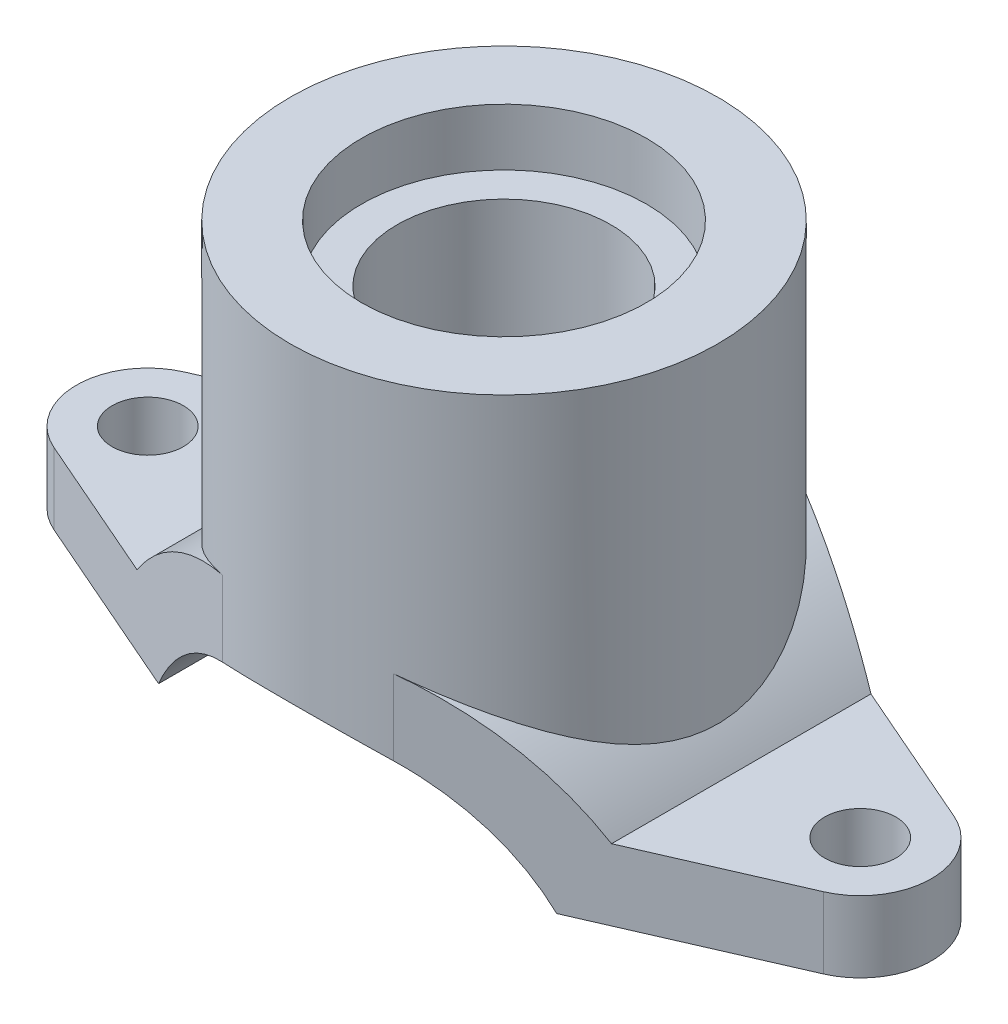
ISO-10303-21;
HEADER;
FILE_DESCRIPTION(('STEP AP214'),'2;1');
FILE_NAME('part.step','',(''),(''),'','','');
FILE_SCHEMA(('AUTOMOTIVE_DESIGN { 1 0 10303 214 1 1 1 1 }'));
ENDSEC;
DATA;
#1=APPLICATION_CONTEXT('core data for automotive mechanical design processes');
#2=APPLICATION_PROTOCOL_DEFINITION('international standard','automotive_design',2000,#1);
#3=PRODUCT_CONTEXT('',#1,'mechanical');
#4=PRODUCT('Part','Part','',(#3));
#5=PRODUCT_RELATED_PRODUCT_CATEGORY('part','',(#4));
#6=PRODUCT_DEFINITION_FORMATION('','',#4);
#7=PRODUCT_DEFINITION_CONTEXT('part definition',#1,'design');
#8=PRODUCT_DEFINITION('design','',#6,#7);
#9=PRODUCT_DEFINITION_SHAPE('','',#8);
#10=(LENGTH_UNIT() NAMED_UNIT(*) SI_UNIT(.MILLI.,.METRE.));
#11=(NAMED_UNIT(*) PLANE_ANGLE_UNIT() SI_UNIT($,.RADIAN.));
#12=(NAMED_UNIT(*) SI_UNIT($,.STERADIAN.) SOLID_ANGLE_UNIT());
#13=UNCERTAINTY_MEASURE_WITH_UNIT(LENGTH_MEASURE(1.E-05),#10,'distance_accuracy_value','');
#14=(GEOMETRIC_REPRESENTATION_CONTEXT(3) GLOBAL_UNCERTAINTY_ASSIGNED_CONTEXT((#13)) GLOBAL_UNIT_ASSIGNED_CONTEXT((#10,
#11,#12)) REPRESENTATION_CONTEXT('',''));
#15=CARTESIAN_POINT('',(0.,0.,0.));
#16=DIRECTION('',(0.,0.,1.));
#17=DIRECTION('',(1.,0.,0.));
#18=AXIS2_PLACEMENT_3D('',#15,#16,#17);
#19=CARTESIAN_POINT('',(0.,-39.,75.));
#20=DIRECTION('',(0.,0.,-1.));
#21=DIRECTION('',(-1.,0.,0.));
#22=AXIS2_PLACEMENT_3D('',#19,#20,#21);
#23=CYLINDRICAL_SURFACE('',#22,80.);
#24=CARTESIAN_POINT('',(0.,-39.,81.8317088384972));
#25=DIRECTION('',(0.4,0.,0.916515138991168));
#26=DIRECTION('',(0.916515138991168,0.,-0.4));
#27=AXIS2_PLACEMENT_3D('',#24,#25,#26);
#28=ELLIPSE('',#27,87.287156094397,80.);
#29=CARTESIAN_POINT('',(30.,35.1619848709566,68.7386354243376));
#30=VERTEX_POINT('',#29);
#31=CARTESIAN_POINT('',(69.8498389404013,0.,51.3467398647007));
#32=VERTEX_POINT('',#31);
#33=EDGE_CURVE('E272',#30,#32,#28,.F.);
#34=ORIENTED_EDGE('',*,*,#33,.F.);
#35=CARTESIAN_POINT('',(-30.,35.1619848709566,68.7386354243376));
#36=CARTESIAN_POINT('',(-29.3003452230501,35.4450166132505,69.0439963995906));
#37=CARTESIAN_POINT('',(-28.5931194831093,35.7195746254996,69.3399312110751));
#38=CARTESIAN_POINT('',(-27.1640794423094,36.2508716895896,69.9121235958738));
#39=CARTESIAN_POINT('',(-26.4422637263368,36.5076090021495,70.1883792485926));
#40=CARTESIAN_POINT('',(-24.9842189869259,37.002512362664,70.7205164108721));
#41=CARTESIAN_POINT('',(-24.24798014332,37.24066516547,70.976383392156));
#42=CARTESIAN_POINT('',(-22.7624474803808,37.6972951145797,71.4666567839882));
#43=CARTESIAN_POINT('',(-22.0131540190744,37.9157727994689,71.7010637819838));
#44=CARTESIAN_POINT('',(-19.7437088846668,38.5412811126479,72.3717933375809));
#45=CARTESIAN_POINT('',(-18.2047847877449,38.9174344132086,72.774600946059));
#46=CARTESIAN_POINT('',(-15.086651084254,39.5807454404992,73.4843485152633));
#47=CARTESIAN_POINT('',(-13.5074512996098,39.867924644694,73.7913116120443));
#48=CARTESIAN_POINT('',(-10.3113417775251,40.349220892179,74.3054984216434));
#49=CARTESIAN_POINT('',(-8.69429503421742,40.5429162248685,74.5122701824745));
#50=CARTESIAN_POINT('',(-5.44124550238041,40.8314433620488,74.8201994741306));
#51=CARTESIAN_POINT('',(-3.80524125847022,40.9262675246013,74.9213488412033));
#52=CARTESIAN_POINT('',(-0.530097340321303,41.0149868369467,75.0159875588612));
#53=CARTESIAN_POINT('',(1.1090326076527,41.0090494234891,75.0096555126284));
#54=CARTESIAN_POINT('',(4.37978944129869,40.8967754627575,74.8898869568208));
#55=CARTESIAN_POINT('',(6.01141691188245,40.7904468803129,74.7764589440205));
#56=CARTESIAN_POINT('',(9.16761899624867,40.4879395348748,74.4535795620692));
#57=CARTESIAN_POINT('',(10.6932513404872,40.2968713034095,74.2495892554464));
#58=CARTESIAN_POINT('',(13.716554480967,39.8301705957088,73.7509559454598));
#59=CARTESIAN_POINT('',(15.2142233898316,39.5545324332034,73.4563068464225));
#60=CARTESIAN_POINT('',(18.1728428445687,38.9232736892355,72.7808423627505));
#61=CARTESIAN_POINT('',(19.6337892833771,38.5676442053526,72.4000173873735));
#62=CARTESIAN_POINT('',(22.5111508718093,37.7819719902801,71.5576292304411));
#63=CARTESIAN_POINT('',(23.9275810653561,37.3519547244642,71.0960936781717));
#64=CARTESIAN_POINT('',(26.1169886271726,36.6215008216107,70.310898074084));
#65=CARTESIAN_POINT('',(26.9068373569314,36.3439811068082,70.0123474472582));
#66=CARTESIAN_POINT('',(28.4673997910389,35.7682897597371,69.3924367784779));
#67=CARTESIAN_POINT('',(29.2381554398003,35.4701701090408,69.0711341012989));
#68=CARTESIAN_POINT('',(30.,35.1619848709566,68.7386354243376));
#69=B_SPLINE_CURVE_WITH_KNOTS('',3,(#35,#36,#37,#38,#39,#40,#41,#42,#43,#44,#45,#46,#47,#48,#49,
#50,#51,#52,#53,#54,#55,#56,#57,#58,#59,#60,#61,#62,#63,#64,#65,#66,#67,#68),.UNSPECIFIED.,.F.,
.F.,(4,2,2,2,2,2,2,2,2,2,2,2,2,2,2,2,4),(0.,2.44240296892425,4.88504397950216,7.32941025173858,
9.77370959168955,14.6716503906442,19.5684079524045,24.4870532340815,29.4060786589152,
34.3169308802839,39.2273935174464,43.8751848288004,48.5232887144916,53.1719101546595,
57.8189433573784,60.4847624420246,63.1440843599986),.UNSPECIFIED.);
#70=CARTESIAN_POINT('',(-30.,35.1619848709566,68.7386354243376));
#71=VERTEX_POINT('',#70);
#72=EDGE_CURVE('E155',#71,#30,#69,.T.);
#73=ORIENTED_EDGE('',*,*,#72,.F.);
#74=CARTESIAN_POINT('',(0.,-39.,81.8317088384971));
#75=DIRECTION('',(-0.4,0.,0.916515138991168));
#76=DIRECTION('',(-0.916515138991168,0.,-0.4));
#77=AXIS2_PLACEMENT_3D('',#74,#75,#76);
#78=ELLIPSE('',#77,87.287156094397,80.);
#79=CARTESIAN_POINT('',(-69.8498389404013,0.,51.3467398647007));
#80=VERTEX_POINT('',#79);
#81=EDGE_CURVE('E327',#80,#71,#78,.F.);
#82=ORIENTED_EDGE('',*,*,#81,.F.);
#83=DIRECTION('',(0.,0.,-1.));
#84=VECTOR('',#83,1.);
#85=CARTESIAN_POINT('',(-69.8498389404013,0.,75.));
#86=LINE('',#85,#84);
#87=CARTESIAN_POINT('',(-69.8498389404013,0.,-51.3467398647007));
#88=VERTEX_POINT('',#87);
#89=EDGE_CURVE('E319',#80,#88,#86,.T.);
#90=ORIENTED_EDGE('',*,*,#89,.T.);
#91=CARTESIAN_POINT('',(0.,-39.,-81.8317088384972));
#92=DIRECTION('',(-0.4,0.,-0.916515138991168));
#93=DIRECTION('',(0.916515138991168,0.,-0.4));
#94=AXIS2_PLACEMENT_3D('',#91,#92,#93);
#95=ELLIPSE('',#94,87.287156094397,80.);
#96=CARTESIAN_POINT('',(-30.,35.1619848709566,-68.7386354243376));
#97=VERTEX_POINT('',#96);
#98=EDGE_CURVE('E59',#97,#88,#95,.F.);
#99=ORIENTED_EDGE('',*,*,#98,.F.);
#100=CARTESIAN_POINT('',(30.0000000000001,35.1619848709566,-68.7386354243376));
#101=CARTESIAN_POINT('',(29.3003452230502,35.4450166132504,-69.0439963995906));
#102=CARTESIAN_POINT('',(28.5931194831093,35.7195746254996,-69.339931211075));
#103=CARTESIAN_POINT('',(27.1640794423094,36.2508716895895,-69.9121235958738));
#104=CARTESIAN_POINT('',(26.4422637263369,36.5076090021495,-70.1883792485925));
#105=CARTESIAN_POINT('',(24.984218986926,37.002512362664,-70.720516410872));
#106=CARTESIAN_POINT('',(24.24798014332,37.24066516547,-70.9763833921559));
#107=CARTESIAN_POINT('',(22.7624474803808,37.6972951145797,-71.4666567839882));
#108=CARTESIAN_POINT('',(22.0131540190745,37.9157727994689,-71.7010637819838));
#109=CARTESIAN_POINT('',(19.7437088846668,38.5412811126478,-72.3717933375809));
#110=CARTESIAN_POINT('',(18.204784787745,38.9174344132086,-72.774600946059));
#111=CARTESIAN_POINT('',(15.086651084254,39.5807454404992,-73.4843485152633));
#112=CARTESIAN_POINT('',(13.5074512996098,39.867924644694,-73.7913116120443));
#113=CARTESIAN_POINT('',(10.3113417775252,40.349220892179,-74.3054984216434));
#114=CARTESIAN_POINT('',(8.69429503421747,40.5429162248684,-74.5122701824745));
#115=CARTESIAN_POINT('',(5.44124550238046,40.8314433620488,-74.8201994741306));
#116=CARTESIAN_POINT('',(3.80524125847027,40.9262675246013,-74.9213488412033));
#117=CARTESIAN_POINT('',(0.530097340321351,41.0149868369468,-75.0159875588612));
#118=CARTESIAN_POINT('',(-1.10903260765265,41.0090494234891,-75.0096555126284));
#119=CARTESIAN_POINT('',(-4.37978944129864,40.8967754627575,-74.8898869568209));
#120=CARTESIAN_POINT('',(-6.01141691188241,40.7904468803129,-74.7764589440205));
#121=CARTESIAN_POINT('',(-9.16761899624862,40.4879395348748,-74.4535795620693));
#122=CARTESIAN_POINT('',(-10.6932513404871,40.2968713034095,-74.2495892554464));
#123=CARTESIAN_POINT('',(-13.716554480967,39.8301705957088,-73.7509559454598));
#124=CARTESIAN_POINT('',(-15.2142233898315,39.5545324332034,-73.4563068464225));
#125=CARTESIAN_POINT('',(-18.1728428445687,38.9232736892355,-72.7808423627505));
#126=CARTESIAN_POINT('',(-19.633789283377,38.5676442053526,-72.4000173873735));
#127=CARTESIAN_POINT('',(-22.5111508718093,37.7819719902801,-71.5576292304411));
#128=CARTESIAN_POINT('',(-23.927581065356,37.3519547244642,-71.0960936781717));
#129=CARTESIAN_POINT('',(-26.1169886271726,36.6215008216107,-70.3108980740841));
#130=CARTESIAN_POINT('',(-26.9068373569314,36.3439811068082,-70.0123474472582));
#131=CARTESIAN_POINT('',(-28.4673997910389,35.7682897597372,-69.392436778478));
#132=CARTESIAN_POINT('',(-29.2381554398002,35.4701701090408,-69.071134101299));
#133=CARTESIAN_POINT('',(-30.,35.1619848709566,-68.7386354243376));
#134=B_SPLINE_CURVE_WITH_KNOTS('',3,(#100,#101,#102,#103,#104,#105,#106,#107,#108,#109,#110,
#111,#112,#113,#114,#115,#116,#117,#118,#119,#120,#121,#122,#123,#124,#125,#126,#127,#128,#129,
#130,#131,#132,#133),.UNSPECIFIED.,.F.,.F.,(4,2,2,2,2,2,2,2,2,2,2,2,2,2,2,2,4),(0.,
2.44240296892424,4.88504397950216,7.32941025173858,9.77370959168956,14.6716503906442,
19.5684079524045,24.4870532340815,29.4060786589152,34.3169308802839,39.2273935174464,
43.8751848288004,48.5232887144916,53.1719101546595,57.8189433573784,60.4847624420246,
63.1440843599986),.UNSPECIFIED.);
#135=CARTESIAN_POINT('',(30.0000000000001,35.1619848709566,-68.7386354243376));
#136=VERTEX_POINT('',#135);
#137=EDGE_CURVE('E159',#136,#97,#134,.T.);
#138=ORIENTED_EDGE('',*,*,#137,.F.);
#139=CARTESIAN_POINT('',(0.,-39.,-81.8317088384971));
#140=DIRECTION('',(0.4,0.,-0.916515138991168));
#141=DIRECTION('',(-0.916515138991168,0.,-0.4));
#142=AXIS2_PLACEMENT_3D('',#139,#140,#141);
#143=ELLIPSE('',#142,87.2871560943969,80.);
#144=CARTESIAN_POINT('',(69.8498389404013,0.,-51.3467398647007));
#145=VERTEX_POINT('',#144);
#146=EDGE_CURVE('E310',#145,#136,#143,.F.);
#147=ORIENTED_EDGE('',*,*,#146,.F.);
#148=DIRECTION('',(0.,0.,-1.));
#149=VECTOR('',#148,1.);
#150=CARTESIAN_POINT('',(69.8498389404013,0.,75.));
#151=LINE('',#150,#149);
#152=EDGE_CURVE('E305',#32,#145,#151,.T.);
#153=ORIENTED_EDGE('',*,*,#152,.F.);
#154=EDGE_LOOP('',(#34,#73,#82,#90,#99,#138,#147,#153));
#155=FACE_BOUND('',#154,.T.);
#156=CARTESIAN_POINT('',(0.,41.,37.5));
#157=CARTESIAN_POINT('',(-0.993424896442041,40.9999942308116,37.499993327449));
#158=CARTESIAN_POINT('',(-1.98702581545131,40.9814491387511,37.4604750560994));
#159=CARTESIAN_POINT('',(-3.96700469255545,40.9077297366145,37.3028148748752));
#160=CARTESIAN_POINT('',(-4.95337867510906,40.8525366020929,37.1846325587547));
#161=CARTESIAN_POINT('',(-6.91303888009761,40.706819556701,36.8706720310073));
#162=CARTESIAN_POINT('',(-7.88629567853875,40.6162266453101,36.6747422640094));
#163=CARTESIAN_POINT('',(-9.81065263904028,40.4020679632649,36.207477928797));
#164=CARTESIAN_POINT('',(-10.7617554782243,40.2785061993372,35.9361525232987));
#165=CARTESIAN_POINT('',(-12.6321460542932,40.0020212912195,35.3220075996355));
#166=CARTESIAN_POINT('',(-13.5515391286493,39.8492092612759,34.9794582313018));
#167=CARTESIAN_POINT('',(-15.3567185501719,39.5175999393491,34.2254016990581));
#168=CARTESIAN_POINT('',(-16.242503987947,39.3388019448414,33.8138926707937));
#169=CARTESIAN_POINT('',(-17.9753922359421,38.9594244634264,32.9254179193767));
#170=CARTESIAN_POINT('',(-18.8225052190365,38.7588507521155,32.4484695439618));
#171=CARTESIAN_POINT('',(-20.4741173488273,38.3403931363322,31.4324779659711));
#172=CARTESIAN_POINT('',(-21.2786151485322,38.1225086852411,30.893432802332));
#173=CARTESIAN_POINT('',(-22.884365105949,37.6618636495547,29.725326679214));
#174=CARTESIAN_POINT('',(-23.6829981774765,37.4183939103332,29.0929431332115));
#175=CARTESIAN_POINT('',(-25.2248095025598,36.9234137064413,27.7667644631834));
#176=CARTESIAN_POINT('',(-25.9679859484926,36.6719029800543,27.0729673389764));
#177=CARTESIAN_POINT('',(-27.3958010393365,36.1667732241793,25.627186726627));
#178=CARTESIAN_POINT('',(-28.0804031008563,35.913152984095,24.8751674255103));
#179=CARTESIAN_POINT('',(-29.0601473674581,35.5361014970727,23.7068822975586));
#180=CARTESIAN_POINT('',(-29.3788818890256,35.4109754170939,23.3107263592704));
#181=CARTESIAN_POINT('',(-30.0003457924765,35.1626000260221,22.5052896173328));
#182=CARTESIAN_POINT('',(-30.3030704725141,35.0393512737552,22.09600501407));
#183=CARTESIAN_POINT('',(-31.2252500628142,34.6576214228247,20.7945277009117));
#184=CARTESIAN_POINT('',(-31.815490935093,34.4039264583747,19.87995031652));
#185=CARTESIAN_POINT('',(-32.9162523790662,33.9169586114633,17.9988222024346));
#186=CARTESIAN_POINT('',(-33.4267775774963,33.6836845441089,17.0322744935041));
#187=CARTESIAN_POINT('',(-34.1292066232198,33.3551240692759,15.5482138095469));
#188=CARTESIAN_POINT('',(-34.3527845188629,33.2491649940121,15.047834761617));
#189=CARTESIAN_POINT('',(-34.7782812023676,33.0453108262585,14.0364522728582));
#190=CARTESIAN_POINT('',(-34.9802055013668,32.9474136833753,13.5254515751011));
#191=CARTESIAN_POINT('',(-35.3618799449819,32.7605924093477,12.4935994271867));
#192=CARTESIAN_POINT('',(-35.5416295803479,32.6716684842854,11.9727477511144));
#193=CARTESIAN_POINT('',(-35.8784072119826,32.5036727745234,10.9221937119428));
#194=CARTESIAN_POINT('',(-36.0354340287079,32.4246015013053,10.3924908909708));
#195=CARTESIAN_POINT('',(-36.4553073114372,32.2116983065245,8.85153754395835));
#196=CARTESIAN_POINT('',(-36.6884170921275,32.0915316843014,7.83005352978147));
#197=CARTESIAN_POINT('',(-37.0687044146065,31.8939852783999,5.76726337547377));
#198=CARTESIAN_POINT('',(-37.215885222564,31.816603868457,4.72595799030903));
#199=CARTESIAN_POINT('',(-37.4222204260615,31.7077869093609,2.63292684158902));
#200=CARTESIAN_POINT('',(-37.4814344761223,31.6763202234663,1.58120862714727));
#201=CARTESIAN_POINT('',(-37.5111108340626,31.6605756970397,-0.52378348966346));
#202=CARTESIAN_POINT('',(-37.4815799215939,31.6762942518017,-1.57705726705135));
#203=CARTESIAN_POINT('',(-37.3417818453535,31.7502403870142,-3.56842468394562));
#204=CARTESIAN_POINT('',(-37.2400630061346,31.8039653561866,-4.50730155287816));
#205=CARTESIAN_POINT('',(-36.9666841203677,31.9470793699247,-6.37197603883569));
#206=CARTESIAN_POINT('',(-36.7950296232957,32.0364655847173,-7.29777468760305));
#207=CARTESIAN_POINT('',(-36.3836145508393,32.2480593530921,-9.13043388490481));
#208=CARTESIAN_POINT('',(-36.1438404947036,32.3702734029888,-10.0372906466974));
#209=CARTESIAN_POINT('',(-35.5985823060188,32.6437985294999,-11.8264869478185));
#210=CARTESIAN_POINT('',(-35.2930950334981,32.7951109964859,-12.7088253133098));
#211=CARTESIAN_POINT('',(-34.6112591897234,33.1263305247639,-14.4643547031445));
#212=CARTESIAN_POINT('',(-34.2334412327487,33.3068156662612,-15.3368675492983));
#213=CARTESIAN_POINT('',(-33.6195730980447,33.5932174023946,-16.6192379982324));
#214=CARTESIAN_POINT('',(-33.4070824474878,33.6913019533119,-17.0423142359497));
#215=CARTESIAN_POINT('',(-32.9666849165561,33.8920865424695,-17.8793553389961));
#216=CARTESIAN_POINT('',(-32.738775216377,33.9947874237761,-18.2933185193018));
#217=CARTESIAN_POINT('',(-32.0324309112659,34.3088600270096,-19.520880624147));
#218=CARTESIAN_POINT('',(-31.5314069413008,34.5261895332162,-20.3200982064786));
#219=CARTESIAN_POINT('',(-30.472144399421,34.9714701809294,-21.8765796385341));
#220=CARTESIAN_POINT('',(-29.9139017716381,35.1994220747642,-22.6338405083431));
#221=CARTESIAN_POINT('',(-29.0036749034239,35.5580902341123,-23.7762209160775));
#222=CARTESIAN_POINT('',(-28.6704407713,35.6869401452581,-24.1769980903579));
#223=CARTESIAN_POINT('',(-27.9877817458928,35.9454287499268,-24.964082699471));
#224=CARTESIAN_POINT('',(-27.6383603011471,36.0750672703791,-25.3503931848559));
#225=CARTESIAN_POINT('',(-26.5663006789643,36.4639604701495,-26.4871004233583));
#226=CARTESIAN_POINT('',(-25.8198457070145,36.7232013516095,-27.2152999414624));
#227=CARTESIAN_POINT('',(-24.2673813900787,37.2349168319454,-28.6082585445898));
#228=CARTESIAN_POINT('',(-23.4613502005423,37.4873889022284,-29.2729941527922));
#229=CARTESIAN_POINT('',(-21.7939808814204,37.9790732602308,-30.5346559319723));
#230=CARTESIAN_POINT('',(-20.9326426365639,38.2182855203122,-31.1315819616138));
#231=CARTESIAN_POINT('',(-19.1269646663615,38.6856490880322,-32.2736963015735));
#232=CARTESIAN_POINT('',(-18.1807456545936,38.9130818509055,-32.8162138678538));
#233=CARTESIAN_POINT('',(-16.2396299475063,39.3406788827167,-33.8188950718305));
#234=CARTESIAN_POINT('',(-15.2447314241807,39.5408421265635,-34.2790556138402));
#235=CARTESIAN_POINT('',(-13.213697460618,39.9079362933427,-35.1119944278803));
#236=CARTESIAN_POINT('',(-12.177585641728,40.0748859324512,-35.4848219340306));
#237=CARTESIAN_POINT('',(-10.0715919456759,40.3706065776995,-36.1390155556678));
#238=CARTESIAN_POINT('',(-9.00171343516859,40.4993813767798,-36.4203907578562));
#239=CARTESIAN_POINT('',(-6.91920815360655,40.7065575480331,-36.8703402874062));
#240=CARTESIAN_POINT('',(-5.90838032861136,40.7880348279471,-37.0458425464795));
#241=CARTESIAN_POINT('',(-3.87341263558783,40.9126743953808,-37.3135316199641));
#242=CARTESIAN_POINT('',(-2.8492734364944,40.9558386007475,-37.4057226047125));
#243=CARTESIAN_POINT('',(-0.796326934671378,41.0026235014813,-37.505622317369));
#244=CARTESIAN_POINT('',(0.232478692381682,41.0062574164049,-37.5133592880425));
#245=CARTESIAN_POINT('',(2.28660413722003,40.9739107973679,-37.4443235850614));
#246=CARTESIAN_POINT('',(3.31192407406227,40.9379316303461,-37.367553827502));
#247=CARTESIAN_POINT('',(5.2830708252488,40.8310596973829,-37.1383564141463));
#248=CARTESIAN_POINT('',(6.22966107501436,40.7626398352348,-36.9912822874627));
#249=CARTESIAN_POINT('',(8.1060241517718,40.5938414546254,-36.6258904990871));
#250=CARTESIAN_POINT('',(9.03579790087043,40.4934646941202,-36.4075767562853));
#251=CARTESIAN_POINT('',(10.8726292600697,40.2631242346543,-35.9018591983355));
#252=CARTESIAN_POINT('',(11.7796854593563,40.1331587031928,-35.6144511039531));
#253=CARTESIAN_POINT('',(13.5656565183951,39.8466300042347,-34.9731798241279));
#254=CARTESIAN_POINT('',(14.4445702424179,39.6900657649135,-34.6193139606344));
#255=CARTESIAN_POINT('',(16.1957761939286,39.3486870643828,-33.836292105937));
#256=CARTESIAN_POINT('',(17.0670483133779,39.1631564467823,-33.4051684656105));
#257=CARTESIAN_POINT('',(18.77002050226,38.7717803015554,-32.4788546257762));
#258=CARTESIAN_POINT('',(19.6017201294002,38.5659345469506,-31.9836637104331));
#259=CARTESIAN_POINT('',(21.2218565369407,38.1384144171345,-30.9324358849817));
#260=CARTESIAN_POINT('',(22.0102780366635,37.916734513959,-30.3763776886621));
#261=CARTESIAN_POINT('',(23.5400112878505,37.4624398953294,-29.2069349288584));
#262=CARTESIAN_POINT('',(24.281320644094,37.2298246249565,-28.5935474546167));
#263=CARTESIAN_POINT('',(25.777152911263,36.7377825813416,-27.255860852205));
#264=CARTESIAN_POINT('',(26.527034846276,36.4778054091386,-26.5265501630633));
#265=CARTESIAN_POINT('',(27.6040096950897,36.0877130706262,-25.3878274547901));
#266=CARTESIAN_POINT('',(27.9550488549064,35.9576523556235,-25.0007659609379));
#267=CARTESIAN_POINT('',(28.6408681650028,35.6982936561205,-24.212059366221));
#268=CARTESIAN_POINT('',(28.975644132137,35.5689958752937,-23.8104105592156));
#269=CARTESIAN_POINT('',(29.9549250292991,35.1835201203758,-22.5842190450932));
#270=CARTESIAN_POINT('',(30.5742544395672,34.9298067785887,-21.7385671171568));
#271=CARTESIAN_POINT('',(31.7415760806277,34.4361908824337,-19.9955588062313));
#272=CARTESIAN_POINT('',(32.2895711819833,34.1962877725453,-19.0982045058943));
#273=CARTESIAN_POINT('',(33.0635656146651,33.848364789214,-17.7016040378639));
#274=CARTESIAN_POINT('',(33.3172356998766,33.7326178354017,-17.2194415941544));
#275=CARTESIAN_POINT('',(33.8038311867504,33.5077428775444,-16.2434091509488));
#276=CARTESIAN_POINT('',(34.0367614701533,33.3986133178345,-15.749541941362));
#277=CARTESIAN_POINT('',(34.7037192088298,33.0825522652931,-14.2512002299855));
#278=CARTESIAN_POINT('',(35.1059633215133,32.886925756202,-13.2298959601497));
#279=CARTESIAN_POINT('',(35.8205213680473,32.5335531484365,-11.1511165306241));
#280=CARTESIAN_POINT('',(36.1329189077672,32.3757718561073,-10.0936760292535));
#281=CARTESIAN_POINT('',(36.6642360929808,32.1043117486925,-7.94999942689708));
#282=CARTESIAN_POINT('',(36.8831679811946,31.9906271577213,-6.86376711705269));
#283=CARTESIAN_POINT('',(37.2088538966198,31.8204183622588,-4.77162438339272));
#284=CARTESIAN_POINT('',(37.3239753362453,31.7596480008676,-3.76735486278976));
#285=CARTESIAN_POINT('',(37.4727243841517,31.6809887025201,-1.75113324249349));
#286=CARTESIAN_POINT('',(37.5063571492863,31.663097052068,-0.739181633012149));
#287=CARTESIAN_POINT('',(37.4916662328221,31.6708920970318,1.28368947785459));
#288=CARTESIAN_POINT('',(37.4433629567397,31.6965679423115,2.29460917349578));
#289=CARTESIAN_POINT('',(37.265508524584,31.790479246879,4.30724829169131));
#290=CARTESIAN_POINT('',(37.135959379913,31.858713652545,5.30896794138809));
#291=CARTESIAN_POINT('',(36.8099469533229,32.0285767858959,7.22133544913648));
#292=CARTESIAN_POINT('',(36.6191740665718,32.1273458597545,8.13321760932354));
#293=CARTESIAN_POINT('',(36.1715151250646,32.3560411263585,9.93652414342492));
#294=CARTESIAN_POINT('',(35.9146332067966,32.4859653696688,10.8279497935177));
#295=CARTESIAN_POINT('',(35.3370987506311,32.7732077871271,12.5855226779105));
#296=CARTESIAN_POINT('',(35.0164325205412,32.9305318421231,13.4516644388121));
#297=CARTESIAN_POINT('',(34.3139901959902,33.2682631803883,15.1541476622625));
#298=CARTESIAN_POINT('',(33.9322103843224,33.4486718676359,15.9904873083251));
#299=CARTESIAN_POINT('',(33.0829683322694,33.8405800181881,17.6839766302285));
#300=CARTESIAN_POINT('',(32.6115015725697,34.0533481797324,18.5388246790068));
#301=CARTESIAN_POINT('',(31.6054192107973,34.4942109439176,20.2063309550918));
#302=CARTESIAN_POINT('',(31.0708016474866,34.7223060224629,21.0189878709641));
#303=CARTESIAN_POINT('',(29.9413527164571,35.1881973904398,22.5988642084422));
#304=CARTESIAN_POINT('',(29.346497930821,35.4259974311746,23.3660657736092));
#305=CARTESIAN_POINT('',(28.0998104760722,35.9055854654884,24.8513755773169));
#306=CARTESIAN_POINT('',(27.4479750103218,36.1473736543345,25.5694814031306));
#307=CARTESIAN_POINT('',(26.0212678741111,36.6539704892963,27.0237668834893));
#308=CARTESIAN_POINT('',(25.2406254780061,36.918618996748,27.75435476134));
#309=CARTESIAN_POINT('',(23.618021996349,37.4389622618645,29.1476009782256));
#310=CARTESIAN_POINT('',(22.7760562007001,37.6946563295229,29.8102540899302));
#311=CARTESIAN_POINT('',(21.034892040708,38.1903683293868,31.0633922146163));
#312=CARTESIAN_POINT('',(20.1356628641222,38.4303776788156,31.6538378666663));
#313=CARTESIAN_POINT('',(18.2855651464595,38.8880347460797,32.7574129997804));
#314=CARTESIAN_POINT('',(17.3347002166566,39.1056840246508,33.2705478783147));
#315=CARTESIAN_POINT('',(15.3917237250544,39.5116240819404,34.2126441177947));
#316=CARTESIAN_POINT('',(14.3998240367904,39.7000464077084,34.6419850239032));
#317=CARTESIAN_POINT('',(12.3773221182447,40.0433669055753,35.4150235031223));
#318=CARTESIAN_POINT('',(11.3467140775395,40.1982600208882,35.7587081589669));
#319=CARTESIAN_POINT('',(9.25763371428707,40.4695087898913,36.3555127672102));
#320=CARTESIAN_POINT('',(8.1992423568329,40.5859653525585,36.6088700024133));
#321=CARTESIAN_POINT('',(6.06131270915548,40.7772567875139,37.0228933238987));
#322=CARTESIAN_POINT('',(4.98178884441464,40.8521190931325,37.1836205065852));
#323=CARTESIAN_POINT('',(3.24989808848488,40.9365883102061,37.3645732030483));
#324=CARTESIAN_POINT('',(2.60123728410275,40.960340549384,37.4153300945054));
#325=CARTESIAN_POINT('',(1.30174287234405,40.9920484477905,37.4830460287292));
#326=CARTESIAN_POINT('',(0.650909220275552,41.0000037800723,37.5000043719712));
#327=CARTESIAN_POINT('',(0.,41.,37.5));
#328=B_SPLINE_CURVE_WITH_KNOTS('',3,(#156,#157,#158,#159,#160,#161,#162,#163,#164,#165,#166,
#167,#168,#169,#170,#171,#172,#173,#174,#175,#176,#177,#178,#179,#180,#181,#182,#183,#184,#185,
#186,#187,#188,#189,#190,#191,#192,#193,#194,#195,#196,#197,#198,#199,#200,#201,#202,#203,#204,
#205,#206,#207,#208,#209,#210,#211,#212,#213,#214,#215,#216,#217,#218,#219,#220,#221,#222,#223,
#224,#225,#226,#227,#228,#229,#230,#231,#232,#233,#234,#235,#236,#237,#238,#239,#240,#241,#242,
#243,#244,#245,#246,#247,#248,#249,#250,#251,#252,#253,#254,#255,#256,#257,#258,#259,#260,#261,
#262,#263,#264,#265,#266,#267,#268,#269,#270,#271,#272,#273,#274,#275,#276,#277,#278,#279,#280,
#281,#282,#283,#284,#285,#286,#287,#288,#289,#290,#291,#292,#293,#294,#295,#296,#297,#298,#299,
#300,#301,#302,#303,#304,#305,#306,#307,#308,#309,#310,#311,#312,#313,#314,#315,#316,#317,#318,
#319,#320,#321,#322,#323,#324,#325,#326,#327),.UNSPECIFIED.,.T.,.F.,(4,2,2,2,2,2,2,2,2,2,2,2,2,
2,2,2,2,2,2,2,2,2,2,2,2,2,2,2,2,2,2,2,2,2,2,2,2,2,2,2,2,2,2,2,2,2,2,2,2,2,2,2,2,2,2,2,2,2,2,2,2,
2,2,2,2,2,2,2,2,2,2,2,2,2,2,2,2,2,2,2,2,2,2,2,2,4),(0.,2.97962709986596,5.96078588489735,
8.94778470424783,11.9344206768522,14.9099286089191,17.8855169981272,20.8603180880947,
23.8352131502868,26.9739533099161,30.1127957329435,33.2535844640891,34.8241161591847,
36.3951065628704,39.7437503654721,43.0921997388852,44.7663314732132,46.4400361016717,
48.1137791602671,49.7876090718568,52.9466577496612,56.1055863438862,59.2623717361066,
62.4189159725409,65.2532748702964,68.0874089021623,70.9221041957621,73.7569349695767,
76.6570256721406,78.1072070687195,79.5576543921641,82.4587315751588,85.3600145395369,
86.9703354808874,88.5803149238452,91.8001674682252,95.0212065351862,98.2422523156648,
101.580428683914,104.918730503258,108.255145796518,111.591229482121,114.674708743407,
117.75803364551,120.840327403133,123.922514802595,126.800354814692,129.678036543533,
132.555896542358,135.433872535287,138.399652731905,141.365466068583,144.332319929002,
147.299324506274,150.529015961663,152.144081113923,153.75955950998,156.9910930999,
160.222496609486,161.892945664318,163.563000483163,166.902796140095,170.239473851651,
173.575714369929,176.609637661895,179.643368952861,182.676344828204,185.709245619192,
188.516678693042,191.323936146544,194.131796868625,196.939828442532,199.934189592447,
202.928643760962,205.924266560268,208.920036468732,212.220536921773,215.521291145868,
218.823836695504,222.12615157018,225.413142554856,228.700628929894,231.979414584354,
235.256035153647,237.208298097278,239.16060144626),.UNSPECIFIED.);
#329=CARTESIAN_POINT('',(0.,41.,37.5));
#330=VERTEX_POINT('',#329);
#331=EDGE_CURVE('E36',#330,#330,#328,.T.);
#332=ORIENTED_EDGE('',*,*,#331,.F.);
#333=EDGE_LOOP('',(#332));
#334=FACE_BOUND('',#333,.T.);
#335=ADVANCED_FACE('F32',(#155,#334),#23,.F.);
#336=CARTESIAN_POINT('',(0.,150.,0.));
#337=DIRECTION('',(0.,1.,0.));
#338=DIRECTION('',(0.,0.,1.));
#339=AXIS2_PLACEMENT_3D('',#336,#337,#338);
#340=PLANE('',#339);
#341=CARTESIAN_POINT('',(0.,150.,0.));
#342=DIRECTION('',(0.,1.,0.));
#343=DIRECTION('',(0.,0.,1.));
#344=AXIS2_PLACEMENT_3D('',#341,#342,#343);
#345=CIRCLE('',#344,75.);
#346=CARTESIAN_POINT('',(0.,150.,75.));
#347=VERTEX_POINT('',#346);
#348=EDGE_CURVE('E140',#347,#347,#345,.T.);
#349=ORIENTED_EDGE('',*,*,#348,.T.);
#350=EDGE_LOOP('',(#349));
#351=FACE_BOUND('',#350,.T.);
#352=CARTESIAN_POINT('',(0.,150.,0.));
#353=DIRECTION('',(0.,1.,0.));
#354=DIRECTION('',(0.,0.,1.));
#355=AXIS2_PLACEMENT_3D('',#352,#353,#354);
#356=CIRCLE('',#355,50.);
#357=CARTESIAN_POINT('',(0.,150.,50.));
#358=VERTEX_POINT('',#357);
#359=EDGE_CURVE('E276',#358,#358,#356,.T.);
#360=ORIENTED_EDGE('',*,*,#359,.F.);
#361=EDGE_LOOP('',(#360));
#362=FACE_BOUND('',#361,.T.);
#363=ADVANCED_FACE('F231',(#351,#362),#340,.T.);
#364=CARTESIAN_POINT('',(0.,-39.,75.));
#365=DIRECTION('',(0.,0.,-1.));
#366=DIRECTION('',(-1.,0.,0.));
#367=AXIS2_PLACEMENT_3D('',#364,#365,#366);
#368=CYLINDRICAL_SURFACE('',#367,105.);
#369=CARTESIAN_POINT('',(0.,-39.,81.8317088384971));
#370=DIRECTION('',(-0.4,0.,0.916515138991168));
#371=DIRECTION('',(-0.916515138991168,0.,-0.4));
#372=AXIS2_PLACEMENT_3D('',#369,#370,#371);
#373=ELLIPSE('',#372,114.564392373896,105.);
#374=CARTESIAN_POINT('',(-30.,61.6230589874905,68.7386354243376));
#375=VERTEX_POINT('',#374);
#376=CARTESIAN_POINT('',(-83.240615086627,25.,45.502526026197));
#377=VERTEX_POINT('',#376);
#378=EDGE_CURVE('E329',#375,#377,#373,.T.);
#379=ORIENTED_EDGE('',*,*,#378,.F.);
#380=CARTESIAN_POINT('',(0.,66.,75.));
#381=CARTESIAN_POINT('',(-0.927941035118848,66.0000001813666,75.0000001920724));
#382=CARTESIAN_POINT('',(-1.85587713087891,65.9876926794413,74.9827726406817));
#383=CARTESIAN_POINT('',(-3.70991339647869,65.9385371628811,74.9139317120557));
#384=CARTESIAN_POINT('',(-4.6360133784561,65.9016867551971,74.8623149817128));
#385=CARTESIAN_POINT('',(-6.48425148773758,65.8036772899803,74.7249161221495));
#386=CARTESIAN_POINT('',(-7.40639014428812,65.7425215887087,74.6391387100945));
#387=CARTESIAN_POINT('',(-9.24508144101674,65.5962672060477,74.4337578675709));
#388=CARTESIAN_POINT('',(-10.1616334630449,65.5111659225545,74.3141507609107));
#389=CARTESIAN_POINT('',(-11.9874853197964,65.3175115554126,74.0415587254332));
#390=CARTESIAN_POINT('',(-12.8967833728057,65.2089528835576,73.888565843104));
#391=CARTESIAN_POINT('',(-14.7063098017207,64.9690220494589,73.5497916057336));
#392=CARTESIAN_POINT('',(-15.6065371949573,64.8376474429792,73.3640067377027));
#393=CARTESIAN_POINT('',(-17.3961496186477,64.5528602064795,72.9603680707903));
#394=CARTESIAN_POINT('',(-18.2855356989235,64.3994497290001,72.7425174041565));
#395=CARTESIAN_POINT('',(-20.0521720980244,64.0714202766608,72.2754820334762));
#396=CARTESIAN_POINT('',(-20.9294211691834,63.8967991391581,72.0262941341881));
#397=CARTESIAN_POINT('',(-22.6658131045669,63.5282615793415,71.4988101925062));
#398=CARTESIAN_POINT('',(-23.525026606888,63.3344507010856,71.2206729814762));
#399=CARTESIAN_POINT('',(-25.2288633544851,62.9277783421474,70.6350925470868));
#400=CARTESIAN_POINT('',(-26.0734852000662,62.7149150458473,70.3276465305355));
#401=CARTESIAN_POINT('',(-28.5835996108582,62.0493564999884,69.3627420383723));
#402=CARTESIAN_POINT('',(-30.2258008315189,61.5695941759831,68.6625768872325));
#403=CARTESIAN_POINT('',(-33.4398608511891,60.5470805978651,67.1559915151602));
#404=CARTESIAN_POINT('',(-35.0117209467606,60.0043305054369,66.3495732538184));
#405=CARTESIAN_POINT('',(-38.0800590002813,58.8651483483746,64.6374173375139));
#406=CARTESIAN_POINT('',(-39.5765332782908,58.2687136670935,63.7316748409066));
#407=CARTESIAN_POINT('',(-42.6205529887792,56.9763615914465,61.7420809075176));
#408=CARTESIAN_POINT('',(-44.1606639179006,56.2763187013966,60.6495426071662));
#409=CARTESIAN_POINT('',(-47.1427943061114,54.8365537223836,58.3617111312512));
#410=CARTESIAN_POINT('',(-48.5848090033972,54.0968297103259,57.1664129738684));
#411=CARTESIAN_POINT('',(-51.3698170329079,52.5895876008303,54.6775530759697));
#412=CARTESIAN_POINT('',(-52.7126705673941,51.822032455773,53.3838576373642));
#413=CARTESIAN_POINT('',(-55.2949626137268,50.2733621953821,50.7043317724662));
#414=CARTESIAN_POINT('',(-56.5343953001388,49.4922463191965,49.3184961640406));
#415=CARTESIAN_POINT('',(-58.4230617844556,48.2493755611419,47.0420640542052));
#416=CARTESIAN_POINT('',(-59.1068248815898,47.7873120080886,46.1800276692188));
#417=CARTESIAN_POINT('',(-60.436662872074,46.8665455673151,44.4254607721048));
#418=CARTESIAN_POINT('',(-61.0827357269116,46.4078428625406,43.5329286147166));
#419=CARTESIAN_POINT('',(-62.3366260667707,45.4970162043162,41.7176498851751));
#420=CARTESIAN_POINT('',(-62.9444315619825,45.0448943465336,40.7948939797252));
#421=CARTESIAN_POINT('',(-64.1206958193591,44.1509590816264,38.9199315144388));
#422=CARTESIAN_POINT('',(-64.6891587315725,43.7091445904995,37.9677280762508));
#423=CARTESIAN_POINT('',(-65.7852178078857,42.8400488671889,36.0352250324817));
#424=CARTESIAN_POINT('',(-66.3128603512,42.4127514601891,35.0549590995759));
#425=CARTESIAN_POINT('',(-67.3267922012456,41.5762705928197,33.0658399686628));
#426=CARTESIAN_POINT('',(-67.8130802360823,41.1670876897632,32.0569858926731));
#427=CARTESIAN_POINT('',(-69.2074984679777,39.9735181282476,28.9890473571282));
#428=CARTESIAN_POINT('',(-70.0520751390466,39.2223926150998,26.8870194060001));
#429=CARTESIAN_POINT('',(-71.3153717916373,38.0687870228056,23.2705420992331));
#430=CARTESIAN_POINT('',(-71.7837525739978,37.631803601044,21.7841612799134));
#431=CARTESIAN_POINT('',(-72.6309207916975,36.8293459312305,18.7670670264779));
#432=CARTESIAN_POINT('',(-73.0097225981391,36.4638602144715,17.2363607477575));
#433=CARTESIAN_POINT('',(-73.6720269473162,35.8174238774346,14.1398142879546));
#434=CARTESIAN_POINT('',(-73.9557033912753,35.536319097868,12.5740438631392));
#435=CARTESIAN_POINT('',(-74.4240240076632,35.0687161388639,9.41360032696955));
#436=CARTESIAN_POINT('',(-74.6086682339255,34.8822179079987,7.81892723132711));
#437=CARTESIAN_POINT('',(-74.8762122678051,34.6110718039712,4.60164472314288));
#438=CARTESIAN_POINT('',(-74.9584322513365,34.5271045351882,2.97892037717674));
#439=CARTESIAN_POINT('',(-75.0171122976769,34.4672356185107,-0.270408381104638));
#440=CARTESIAN_POINT('',(-74.9935756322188,34.4913306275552,-1.89701267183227));
#441=CARTESIAN_POINT('',(-74.8412098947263,34.6464858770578,-5.14124333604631));
#442=CARTESIAN_POINT('',(-74.7123059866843,34.7776221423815,-6.7588625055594));
#443=CARTESIAN_POINT('',(-74.3518022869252,35.1409082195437,-9.97109938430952));
#444=CARTESIAN_POINT('',(-74.1201908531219,35.3730694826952,-11.5657144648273));
#445=CARTESIAN_POINT('',(-73.5226204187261,35.9641422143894,-14.9228139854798));
#446=CARTESIAN_POINT('',(-73.1432797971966,36.3354559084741,-16.6807238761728));
#447=CARTESIAN_POINT('',(-72.2666607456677,37.1767521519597,-20.1424915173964));
#448=CARTESIAN_POINT('',(-71.7693642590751,37.6467498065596,-21.8463409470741));
#449=CARTESIAN_POINT('',(-70.6632073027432,38.6677425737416,-25.1957951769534));
#450=CARTESIAN_POINT('',(-70.0541444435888,39.2188842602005,-26.8412877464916));
#451=CARTESIAN_POINT('',(-68.7315212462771,40.3835871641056,-30.066875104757));
#452=CARTESIAN_POINT('',(-68.0179517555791,40.9971538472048,-31.6469641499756));
#453=CARTESIAN_POINT('',(-66.7551036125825,42.050480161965,-34.2057275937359));
#454=CARTESIAN_POINT('',(-66.2340297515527,42.4772095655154,-35.2038906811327));
#455=CARTESIAN_POINT('',(-65.1506116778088,43.3460976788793,-37.1706628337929));
#456=CARTESIAN_POINT('',(-64.5882686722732,43.7882559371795,-38.1392727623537));
#457=CARTESIAN_POINT('',(-63.4232155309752,44.6841439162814,-40.0467868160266));
#458=CARTESIAN_POINT('',(-62.8204940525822,45.137876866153,-40.985682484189));
#459=CARTESIAN_POINT('',(-61.5757055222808,46.0530966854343,-42.8330835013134));
#460=CARTESIAN_POINT('',(-60.9336391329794,46.5145834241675,-43.7415893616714));
#461=CARTESIAN_POINT('',(-59.6103462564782,47.4422355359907,-45.5284929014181));
#462=CARTESIAN_POINT('',(-58.929088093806,47.908404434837,-46.406865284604));
#463=CARTESIAN_POINT('',(-57.5285125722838,48.8417808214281,-48.1321597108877));
#464=CARTESIAN_POINT('',(-56.8091949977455,49.3089883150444,-48.9790815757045));
#465=CARTESIAN_POINT('',(-55.3331220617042,50.2412882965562,-50.6406992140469));
#466=CARTESIAN_POINT('',(-54.5763701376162,50.7063809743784,-51.4553979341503));
#467=CARTESIAN_POINT('',(-53.0258927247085,51.631504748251,-53.0517933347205));
#468=CARTESIAN_POINT('',(-52.2321679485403,52.0915359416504,-53.833490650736));
#469=CARTESIAN_POINT('',(-50.6001042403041,53.0082288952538,-55.3705565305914));
#470=CARTESIAN_POINT('',(-49.761398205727,53.4648108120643,-56.1255831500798));
#471=CARTESIAN_POINT('',(-48.0473363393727,54.3669718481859,-57.5997502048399));
#472=CARTESIAN_POINT('',(-47.1719810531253,54.812551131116,-58.318891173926));
#473=CARTESIAN_POINT('',(-45.3850572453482,55.6899545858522,-59.7200628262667));
#474=CARTESIAN_POINT('',(-44.4734814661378,56.1217759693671,-60.4020860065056));
#475=CARTESIAN_POINT('',(-42.6151617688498,56.9686953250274,-61.7272234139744));
#476=CARTESIAN_POINT('',(-41.668422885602,57.3837956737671,-62.3703431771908));
#477=CARTESIAN_POINT('',(-39.742265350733,58.1938369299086,-63.6149728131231));
#478=CARTESIAN_POINT('',(-38.762907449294,58.588812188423,-64.2165542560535));
#479=CARTESIAN_POINT('',(-36.7711735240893,59.3565950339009,-65.3774371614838));
#480=CARTESIAN_POINT('',(-35.7588019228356,59.7294055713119,-65.9367442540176));
#481=CARTESIAN_POINT('',(-33.7024890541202,60.4501318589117,-67.0110991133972));
#482=CARTESIAN_POINT('',(-32.6585552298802,60.7980534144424,-67.5261572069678));
#483=CARTESIAN_POINT('',(-30.540701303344,61.466406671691,-68.5100658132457));
#484=CARTESIAN_POINT('',(-29.4667836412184,61.7868406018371,-68.9789200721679));
#485=CARTESIAN_POINT('',(-26.7592494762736,62.5468848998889,-70.08567553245));
#486=CARTESIAN_POINT('',(-25.1083769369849,62.9682924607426,-70.6943400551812));
#487=CARTESIAN_POINT('',(-21.7524623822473,63.7365236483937,-71.7979816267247));
#488=CARTESIAN_POINT('',(-20.0474292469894,64.0833594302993,-72.2929772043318));
#489=CARTESIAN_POINT('',(-16.5935346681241,64.6953623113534,-73.1629947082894));
#490=CARTESIAN_POINT('',(-14.8446978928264,64.9605743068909,-73.5380825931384));
#491=CARTESIAN_POINT('',(-11.3138195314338,65.4038467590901,-74.1634135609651));
#492=CARTESIAN_POINT('',(-9.53177701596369,65.5819047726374,-74.4136531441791));
#493=CARTESIAN_POINT('',(-5.94177658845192,65.8472459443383,-74.7861094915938));
#494=CARTESIAN_POINT('',(-4.13375385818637,65.934235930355,-74.9079127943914));
#495=CARTESIAN_POINT('',(-0.511544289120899,66.0143797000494,-75.0201406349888));
#496=CARTESIAN_POINT('',(1.30264253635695,66.0075336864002,-75.0105654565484));
#497=CARTESIAN_POINT('',(4.92292171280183,65.9001659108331,-74.8601866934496));
#498=CARTESIAN_POINT('',(6.72901329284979,65.7996354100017,-74.7193708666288));
#499=CARTESIAN_POINT('',(10.318908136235,65.5072406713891,-74.3087082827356));
#500=CARTESIAN_POINT('',(12.1027118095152,65.3153781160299,-74.0388639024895));
#501=CARTESIAN_POINT('',(15.5506424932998,64.8559435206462,-73.3900996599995));
#502=CARTESIAN_POINT('',(17.2164157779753,64.5924261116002,-73.0170063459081));
#503=CARTESIAN_POINT('',(20.5061231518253,63.9917215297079,-72.1622279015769));
#504=CARTESIAN_POINT('',(22.1300589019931,63.6545372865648,-71.6805470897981));
#505=CARTESIAN_POINT('',(25.3278886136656,62.9126722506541,-70.6140178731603));
#506=CARTESIAN_POINT('',(26.9017782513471,62.5079856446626,-70.0291605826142));
#507=CARTESIAN_POINT('',(29.9925812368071,61.6380800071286,-68.7621642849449));
#508=CARTESIAN_POINT('',(31.5094912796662,61.172857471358,-68.0800196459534));
#509=CARTESIAN_POINT('',(34.6157999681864,60.1446430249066,-66.5582676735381));
#510=CARTESIAN_POINT('',(36.1992787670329,59.5766095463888,-65.7099875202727));
#511=CARTESIAN_POINT('',(39.2866049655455,58.3873701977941,-63.9120837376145));
#512=CARTESIAN_POINT('',(40.790448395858,57.7661616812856,-62.9624550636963));
#513=CARTESIAN_POINT('',(43.7155034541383,56.4804094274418,-60.9679451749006));
#514=CARTESIAN_POINT('',(45.1366631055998,55.8158389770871,-59.9230050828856));
#515=CARTESIAN_POINT('',(47.8924988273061,54.454113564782,-57.744216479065));
#516=CARTESIAN_POINT('',(49.2271704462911,53.7569569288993,-56.6103633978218));
#517=CARTESIAN_POINT('',(52.0415269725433,52.2123928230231,-54.0456392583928));
#518=CARTESIAN_POINT('',(53.5037222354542,51.3606330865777,-52.5981580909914));
#519=CARTESIAN_POINT('',(56.301358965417,49.6445180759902,-49.5920769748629));
#520=CARTESIAN_POINT('',(57.6367790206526,48.7801607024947,-48.0334583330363));
#521=CARTESIAN_POINT('',(60.1779704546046,47.0579387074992,-44.8087993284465));
#522=CARTESIAN_POINT('',(61.3836680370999,46.2000780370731,-43.1426986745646));
#523=CARTESIAN_POINT('',(63.6599613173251,44.5129646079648,-39.707109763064));
#524=CARTESIAN_POINT('',(64.7305808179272,43.6837068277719,-37.9376398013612));
#525=CARTESIAN_POINT('',(66.5754671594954,42.2027204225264,-34.5801213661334));
#526=CARTESIAN_POINT('',(67.369942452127,41.5434079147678,-33.006511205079));
#527=CARTESIAN_POINT('',(68.8531926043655,40.2791733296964,-29.7888506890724));
#528=CARTESIAN_POINT('',(69.5419684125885,39.674250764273,-28.1448009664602));
#529=CARTESIAN_POINT('',(70.8063703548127,38.5382449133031,-24.7923675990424));
#530=CARTESIAN_POINT('',(71.3821918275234,38.0070346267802,-23.0841012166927));
#531=CARTESIAN_POINT('',(72.4146398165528,37.0369825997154,-19.6063100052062));
#532=CARTESIAN_POINT('',(72.8712951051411,36.5981185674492,-17.8368000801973));
#533=CARTESIAN_POINT('',(73.5842932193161,35.903612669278,-14.580441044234));
#534=CARTESIAN_POINT('',(73.8621018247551,35.6290704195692,-13.1023106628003));
#535=CARTESIAN_POINT('',(74.3295447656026,35.1635230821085,-10.1191423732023));
#536=CARTESIAN_POINT('',(74.5191900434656,34.9725076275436,-8.6141078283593));
#537=CARTESIAN_POINT('',(74.8069701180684,34.6814726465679,-5.58793054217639));
#538=CARTESIAN_POINT('',(74.9051912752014,34.5813672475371,-4.06680437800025));
#539=CARTESIAN_POINT('',(75.0085984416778,34.4759537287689,-1.01804101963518));
#540=CARTESIAN_POINT('',(75.013783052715,34.4706470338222,0.509596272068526));
#541=CARTESIAN_POINT('',(74.9310092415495,34.5550624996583,3.55971126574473));
#542=CARTESIAN_POINT('',(74.8430484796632,34.6447870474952,5.08218883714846));
#543=CARTESIAN_POINT('',(74.5756446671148,34.9155536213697,8.11076906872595));
#544=CARTESIAN_POINT('',(74.3962019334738,35.0965953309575,9.61687178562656));
#545=CARTESIAN_POINT('',(73.9486197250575,35.543284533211,12.6050518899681));
#546=CARTESIAN_POINT('',(73.6803633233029,35.8090435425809,14.0870948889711));
#547=CARTESIAN_POINT('',(73.0591966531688,36.4157930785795,17.0175918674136));
#548=CARTESIAN_POINT('',(72.7062746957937,36.7567939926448,18.4660411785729));
#549=CARTESIAN_POINT('',(71.7867868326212,37.6301765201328,21.8081059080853));
#550=CARTESIAN_POINT('',(71.1883484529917,38.1882562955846,23.6862870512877));
#551=CARTESIAN_POINT('',(69.8571622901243,39.3950458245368,27.3643143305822));
#552=CARTESIAN_POINT('',(69.1243670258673,40.0437875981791,29.1641324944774));
#553=CARTESIAN_POINT('',(67.5319203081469,41.4085850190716,32.6829299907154));
#554=CARTESIAN_POINT('',(66.6721090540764,42.124725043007,34.4018038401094));
#555=CARTESIAN_POINT('',(64.8329718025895,43.6019182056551,37.7536790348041));
#556=CARTESIAN_POINT('',(63.8536548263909,44.3629679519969,39.3866868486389));
#557=CARTESIAN_POINT('',(61.7524531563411,45.9317344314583,42.6078754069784));
#558=CARTESIAN_POINT('',(60.6274444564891,46.7401556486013,44.1936722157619));
#559=CARTESIAN_POINT('',(58.2603611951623,48.3658513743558,47.2704719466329));
#560=CARTESIAN_POINT('',(57.018286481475,49.1831258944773,48.7614747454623));
#561=CARTESIAN_POINT('',(54.4196797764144,50.8100753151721,51.6455951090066));
#562=CARTESIAN_POINT('',(53.0631115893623,51.6197477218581,53.0386814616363));
#563=CARTESIAN_POINT('',(50.2381795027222,53.2158157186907,55.7218042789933));
#564=CARTESIAN_POINT('',(48.7698044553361,54.0022089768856,57.0118304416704));
#565=CARTESIAN_POINT('',(46.3553445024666,55.2187915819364,58.9703438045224));
#566=CARTESIAN_POINT('',(45.4447310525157,55.6616536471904,59.6750260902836));
#567=CARTESIAN_POINT('',(43.5870243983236,56.5312655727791,61.0450903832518));
#568=CARTESIAN_POINT('',(42.6399346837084,56.958016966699,61.7104761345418));
#569=CARTESIAN_POINT('',(40.7098221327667,57.7926459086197,63.0004617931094));
#570=CARTESIAN_POINT('',(39.7267879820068,58.2005174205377,63.6250486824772));
#571=CARTESIAN_POINT('',(37.7262841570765,58.9943124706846,64.8312536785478));
#572=CARTESIAN_POINT('',(36.7088195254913,59.3802392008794,65.4128780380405));
#573=CARTESIAN_POINT('',(34.6418328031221,60.1269364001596,66.5306114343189));
#574=CARTESIAN_POINT('',(33.5923485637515,60.4877350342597,67.0667715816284));
#575=CARTESIAN_POINT('',(31.4619911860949,61.1818241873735,68.0921455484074));
#576=CARTESIAN_POINT('',(30.3811226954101,61.5151187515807,68.5813662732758));
#577=CARTESIAN_POINT('',(28.1900707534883,62.1514756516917,69.5106874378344));
#578=CARTESIAN_POINT('',(27.0798942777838,62.4545451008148,69.9507994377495));
#579=CARTESIAN_POINT('',(24.8323470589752,63.02793375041,70.779862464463));
#580=CARTESIAN_POINT('',(23.6949784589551,63.298255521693,71.1688175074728));
#581=CARTESIAN_POINT('',(21.6475792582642,63.748370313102,71.8141256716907));
#582=CARTESIAN_POINT('',(20.7423108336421,63.9350242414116,72.0808639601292));
#583=CARTESIAN_POINT('',(18.9182962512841,64.2858191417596,72.5809355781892));
#584=CARTESIAN_POINT('',(17.9995506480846,64.4499610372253,72.8142702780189));
#585=CARTESIAN_POINT('',(16.1502870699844,64.7547410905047,73.2466368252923));
#586=CARTESIAN_POINT('',(15.2197706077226,64.8953822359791,73.4456730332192));
#587=CARTESIAN_POINT('',(13.3485741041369,65.152327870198,73.8086976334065));
#588=CARTESIAN_POINT('',(12.4078939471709,65.2686320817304,73.9726856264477));
#589=CARTESIAN_POINT('',(10.5189967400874,65.4760868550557,74.2648186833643));
#590=CARTESIAN_POINT('',(9.57078626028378,65.5672572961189,74.3929920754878));
#591=CARTESIAN_POINT('',(7.66806699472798,65.7239798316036,74.6131216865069));
#592=CARTESIAN_POINT('',(6.71355826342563,65.7895321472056,74.7050782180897));
#593=CARTESIAN_POINT('',(4.80027606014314,65.8945912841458,74.8523743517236));
#594=CARTESIAN_POINT('',(3.84150253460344,65.9340977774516,74.9077134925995));
#595=CARTESIAN_POINT('',(1.92181756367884,65.9868019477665,74.9815260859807));
#596=CARTESIAN_POINT('',(0.960906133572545,65.9999998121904,74.9999998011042));
#597=CARTESIAN_POINT('',(0.,66.,75.));
#598=B_SPLINE_CURVE_WITH_KNOTS('',3,(#380,#381,#382,#383,#384,#385,#386,#387,#388,#389,#390,
#391,#392,#393,#394,#395,#396,#397,#398,#399,#400,#401,#402,#403,#404,#405,#406,#407,#408,#409,
#410,#411,#412,#413,#414,#415,#416,#417,#418,#419,#420,#421,#422,#423,#424,#425,#426,#427,#428,
#429,#430,#431,#432,#433,#434,#435,#436,#437,#438,#439,#440,#441,#442,#443,#444,#445,#446,#447,
#448,#449,#450,#451,#452,#453,#454,#455,#456,#457,#458,#459,#460,#461,#462,#463,#464,#465,#466,
#467,#468,#469,#470,#471,#472,#473,#474,#475,#476,#477,#478,#479,#480,#481,#482,#483,#484,#485,
#486,#487,#488,#489,#490,#491,#492,#493,#494,#495,#496,#497,#498,#499,#500,#501,#502,#503,#504,
#505,#506,#507,#508,#509,#510,#511,#512,#513,#514,#515,#516,#517,#518,#519,#520,#521,#522,#523,
#524,#525,#526,#527,#528,#529,#530,#531,#532,#533,#534,#535,#536,#537,#538,#539,#540,#541,#542,
#543,#544,#545,#546,#547,#548,#549,#550,#551,#552,#553,#554,#555,#556,#557,#558,#559,#560,#561,
#562,#563,#564,#565,#566,#567,#568,#569,#570,#571,#572,#573,#574,#575,#576,#577,#578,#579,#580,
#581,#582,#583,#584,#585,#586,#587,#588,#589,#590,#591,#592,#593,#594,#595,#596,#597),
.UNSPECIFIED.,.T.,.F.,(4,2,2,2,2,2,2,2,2,2,2,2,2,2,2,2,2,2,2,2,2,2,2,2,2,2,2,2,2,2,2,2,2,2,2,2,
2,2,2,2,2,2,2,2,2,2,2,2,2,2,2,2,2,2,2,2,2,2,2,2,2,2,2,2,2,2,2,2,2,2,2,2,2,2,2,2,2,2,2,2,2,2,2,2,
2,2,2,2,2,2,2,2,2,2,2,2,2,2,2,2,2,2,2,2,2,2,2,2,4),(0.,2.78357364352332,5.56741873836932,
8.35087955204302,11.1346429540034,13.9190702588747,16.7037960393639,19.488249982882,
22.27298806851,25.0431813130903,27.8136388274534,33.353086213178,38.8924314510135,
44.4320468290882,50.4679235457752,56.5040930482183,62.5486160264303,68.5934792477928,
72.1727428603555,75.7521998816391,79.3327728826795,82.9129676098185,86.4890329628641,
90.0652082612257,97.2117561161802,102.063453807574,106.914372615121,111.75637435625,
116.598373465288,121.472342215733,126.346160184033,131.223442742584,136.10127829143,
141.602168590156,147.103901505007,152.615697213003,158.12797592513,161.739316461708,
165.350551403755,168.962805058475,172.574997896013,176.190152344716,179.805327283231,
183.42017087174,187.034944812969,190.685908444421,194.336817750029,197.988462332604,
201.639586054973,205.284253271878,208.928434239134,212.571762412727,216.214794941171,
221.636596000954,227.057512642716,232.475442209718,237.893523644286,243.328994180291,
248.764452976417,254.200418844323,259.636284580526,264.812469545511,269.988448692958,
275.164873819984,280.341598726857,285.988253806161,291.635190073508,297.285638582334,
302.936377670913,309.610098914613,316.284945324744,322.963569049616,329.641014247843,
335.282598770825,340.924132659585,346.555822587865,352.186151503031,356.768105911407,
361.349491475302,365.926544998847,370.503667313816,375.080904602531,379.658126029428,
384.241397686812,388.825302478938,394.96219712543,401.101264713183,407.248122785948,
413.394517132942,419.706083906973,426.017658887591,432.331236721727,438.645444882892,
442.345334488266,446.044871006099,449.745582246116,453.44575381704,457.141708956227,
460.837119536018,464.531658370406,468.225906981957,471.111117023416,473.996208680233,
476.880933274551,479.76569072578,482.648159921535,485.530604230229,488.413084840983,
491.295544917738),.UNSPECIFIED.);
#599=CARTESIAN_POINT('',(-30.,61.6230589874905,-68.7386354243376));
#600=VERTEX_POINT('',#599);
#601=EDGE_CURVE('E12',#375,#600,#598,.T.);
#602=ORIENTED_EDGE('',*,*,#601,.T.);
#603=CARTESIAN_POINT('',(0.,-39.,-81.8317088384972));
#604=DIRECTION('',(-0.4,0.,-0.916515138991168));
#605=DIRECTION('',(0.916515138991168,0.,-0.4));
#606=AXIS2_PLACEMENT_3D('',#603,#604,#605);
#607=ELLIPSE('',#606,114.564392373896,105.);
#608=CARTESIAN_POINT('',(-83.240615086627,25.,-45.502526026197));
#609=VERTEX_POINT('',#608);
#610=EDGE_CURVE('E335',#609,#600,#607,.T.);
#611=ORIENTED_EDGE('',*,*,#610,.F.);
#612=DIRECTION('',(0.,0.,-1.));
#613=VECTOR('',#612,1.);
#614=CARTESIAN_POINT('',(-83.240615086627,25.,75.));
#615=LINE('',#614,#613);
#616=EDGE_CURVE('E314',#377,#609,#615,.T.);
#617=ORIENTED_EDGE('',*,*,#616,.F.);
#618=EDGE_LOOP('',(#379,#602,#611,#617));
#619=FACE_BOUND('',#618,.T.);
#620=ADVANCED_FACE('F225',(#619),#368,.T.);
#621=CARTESIAN_POINT('',(150.,0.,75.));
#622=DIRECTION('',(0.,1.,0.));
#623=DIRECTION('',(-1.,0.,0.));
#624=AXIS2_PLACEMENT_3D('',#621,#622,#623);
#625=PLANE('',#624);
#626=CARTESIAN_POINT('',(125.,0.,0.));
#627=DIRECTION('',(0.,1.,0.));
#628=DIRECTION('',(-1.,0.,0.));
#629=AXIS2_PLACEMENT_3D('',#626,#627,#628);
#630=CIRCLE('',#629,12.5);
#631=CARTESIAN_POINT('',(112.5,0.,0.));
#632=VERTEX_POINT('',#631);
#633=EDGE_CURVE('E291',#632,#632,#630,.T.);
#634=ORIENTED_EDGE('',*,*,#633,.T.);
#635=EDGE_LOOP('',(#634));
#636=FACE_BOUND('',#635,.T.);
#637=DIRECTION('',(0.916515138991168,0.,-0.4));
#638=VECTOR('',#637,1.);
#639=CARTESIAN_POINT('',(135.,0.,22.9128784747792));
#640=LINE('',#639,#638);
#641=CARTESIAN_POINT('',(135.,0.,22.9128784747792));
#642=VERTEX_POINT('',#641);
#643=EDGE_CURVE('E177',#32,#642,#640,.T.);
#644=ORIENTED_EDGE('',*,*,#643,.F.);
#645=ORIENTED_EDGE('',*,*,#152,.T.);
#646=DIRECTION('',(-0.916515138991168,0.,-0.4));
#647=VECTOR('',#646,1.);
#648=CARTESIAN_POINT('',(135.,0.,-22.9128784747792));
#649=LINE('',#648,#647);
#650=CARTESIAN_POINT('',(135.,0.,-22.9128784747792));
#651=VERTEX_POINT('',#650);
#652=EDGE_CURVE('E352',#651,#145,#649,.T.);
#653=ORIENTED_EDGE('',*,*,#652,.F.);
#654=CARTESIAN_POINT('',(125.,0.,0.));
#655=DIRECTION('',(0.,1.,0.));
#656=DIRECTION('',(-1.,0.,0.));
#657=AXIS2_PLACEMENT_3D('',#654,#655,#656);
#658=CIRCLE('',#657,25.);
#659=EDGE_CURVE('E139',#642,#651,#658,.T.);
#660=ORIENTED_EDGE('',*,*,#659,.F.);
#661=EDGE_LOOP('',(#644,#645,#653,#660));
#662=FACE_BOUND('',#661,.T.);
#663=ADVANCED_FACE('F215',(#636,#662),#625,.F.);
#664=CARTESIAN_POINT('',(-69.8498389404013,0.,75.));
#665=DIRECTION('',(0.,1.,0.));
#666=DIRECTION('',(-1.,0.,0.));
#667=AXIS2_PLACEMENT_3D('',#664,#665,#666);
#668=PLANE('',#667);
#669=CARTESIAN_POINT('',(-125.,-1.11022302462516E-13,0.));
#670=DIRECTION('',(0.,1.,0.));
#671=DIRECTION('',(-1.,0.,0.));
#672=AXIS2_PLACEMENT_3D('',#669,#670,#671);
#673=CIRCLE('',#672,12.5);
#674=CARTESIAN_POINT('',(-137.5,-1.12971155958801E-13,0.));
#675=VERTEX_POINT('',#674);
#676=EDGE_CURVE('E287',#675,#675,#673,.T.);
#677=ORIENTED_EDGE('',*,*,#676,.T.);
#678=EDGE_LOOP('',(#677));
#679=FACE_BOUND('',#678,.T.);
#680=DIRECTION('',(0.916515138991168,0.,0.4));
#681=VECTOR('',#680,1.);
#682=CARTESIAN_POINT('',(-135.,0.,22.9128784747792));
#683=LINE('',#682,#681);
#684=CARTESIAN_POINT('',(-135.,0.,22.9128784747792));
#685=VERTEX_POINT('',#684);
#686=EDGE_CURVE('E307',#685,#80,#683,.T.);
#687=ORIENTED_EDGE('',*,*,#686,.F.);
#688=CARTESIAN_POINT('',(-125.,0.,0.));
#689=DIRECTION('',(0.,1.,0.));
#690=DIRECTION('',(-1.,0.,0.));
#691=AXIS2_PLACEMENT_3D('',#688,#689,#690);
#692=CIRCLE('',#691,25.);
#693=CARTESIAN_POINT('',(-135.,0.,-22.9128784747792));
#694=VERTEX_POINT('',#693);
#695=EDGE_CURVE('E347',#694,#685,#692,.T.);
#696=ORIENTED_EDGE('',*,*,#695,.F.);
#697=DIRECTION('',(-0.916515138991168,0.,0.4));
#698=VECTOR('',#697,1.);
#699=CARTESIAN_POINT('',(-135.,0.,-22.9128784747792));
#700=LINE('',#699,#698);
#701=EDGE_CURVE('E349',#88,#694,#700,.T.);
#702=ORIENTED_EDGE('',*,*,#701,.F.);
#703=ORIENTED_EDGE('',*,*,#89,.F.);
#704=EDGE_LOOP('',(#687,#696,#702,#703));
#705=FACE_BOUND('',#704,.T.);
#706=ADVANCED_FACE('F211',(#679,#705),#668,.F.);
#707=CARTESIAN_POINT('',(125.,0.,0.));
#708=DIRECTION('',(0.,1.,0.));
#709=DIRECTION('',(-1.,0.,0.));
#710=AXIS2_PLACEMENT_3D('',#707,#708,#709);
#711=CYLINDRICAL_SURFACE('',#710,25.);
#712=ORIENTED_EDGE('',*,*,#659,.T.);
#713=DIRECTION('',(0.,1.,0.));
#714=VECTOR('',#713,1.);
#715=CARTESIAN_POINT('',(135.,0.,-22.9128784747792));
#716=LINE('',#715,#714);
#717=CARTESIAN_POINT('',(135.,25.,-22.9128784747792));
#718=VERTEX_POINT('',#717);
#719=EDGE_CURVE('E174',#651,#718,#716,.T.);
#720=ORIENTED_EDGE('',*,*,#719,.T.);
#721=CARTESIAN_POINT('',(125.,25.,0.));
#722=DIRECTION('',(0.,-1.,0.));
#723=DIRECTION('',(1.,0.,0.));
#724=AXIS2_PLACEMENT_3D('',#721,#722,#723);
#725=CIRCLE('',#724,25.);
#726=CARTESIAN_POINT('',(135.,25.,22.9128784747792));
#727=VERTEX_POINT('',#726);
#728=EDGE_CURVE('E44',#718,#727,#725,.T.);
#729=ORIENTED_EDGE('',*,*,#728,.T.);
#730=DIRECTION('',(0.,1.,0.));
#731=VECTOR('',#730,1.);
#732=CARTESIAN_POINT('',(135.,0.,22.9128784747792));
#733=LINE('',#732,#731);
#734=EDGE_CURVE('E156',#642,#727,#733,.T.);
#735=ORIENTED_EDGE('',*,*,#734,.F.);
#736=EDGE_LOOP('',(#712,#720,#729,#735));
#737=FACE_BOUND('',#736,.T.);
#738=ADVANCED_FACE('F208',(#737),#711,.T.);
#739=CARTESIAN_POINT('',(135.,0.,22.9128784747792));
#740=DIRECTION('',(0.4,0.,0.916515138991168));
#741=DIRECTION('',(0.916515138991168,0.,-0.4));
#742=AXIS2_PLACEMENT_3D('',#739,#740,#741);
#743=PLANE('',#742);
#744=ORIENTED_EDGE('',*,*,#33,.T.);
#745=ORIENTED_EDGE('',*,*,#643,.T.);
#746=ORIENTED_EDGE('',*,*,#734,.T.);
#747=DIRECTION('',(-0.916515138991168,0.,0.4));
#748=VECTOR('',#747,1.);
#749=CARTESIAN_POINT('',(72.4266625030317,25.,50.2221218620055));
#750=LINE('',#749,#748);
#751=CARTESIAN_POINT('',(83.240615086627,25.,45.502526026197));
#752=VERTEX_POINT('',#751);
#753=EDGE_CURVE('E149',#727,#752,#750,.T.);
#754=ORIENTED_EDGE('',*,*,#753,.T.);
#755=CARTESIAN_POINT('',(0.,-39.,81.8317088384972));
#756=DIRECTION('',(0.4,0.,0.916515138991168));
#757=DIRECTION('',(0.916515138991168,0.,-0.4));
#758=AXIS2_PLACEMENT_3D('',#755,#756,#757);
#759=ELLIPSE('',#758,114.564392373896,105.);
#760=CARTESIAN_POINT('',(30.,61.6230589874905,68.7386354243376));
#761=VERTEX_POINT('',#760);
#762=EDGE_CURVE('E132',#752,#761,#759,.T.);
#763=ORIENTED_EDGE('',*,*,#762,.T.);
#764=DIRECTION('',(0.,1.,0.));
#765=VECTOR('',#764,1.);
#766=CARTESIAN_POINT('',(30.,0.,68.7386354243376));
#767=LINE('',#766,#765);
#768=EDGE_CURVE('E145',#30,#761,#767,.T.);
#769=ORIENTED_EDGE('',*,*,#768,.F.);
#770=EDGE_LOOP('',(#744,#745,#746,#754,#763,#769));
#771=FACE_BOUND('',#770,.T.);
#772=ADVANCED_FACE('F144',(#771),#743,.T.);
#773=CARTESIAN_POINT('',(135.,0.,-22.9128784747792));
#774=DIRECTION('',(0.4,0.,-0.916515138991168));
#775=DIRECTION('',(-0.916515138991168,0.,-0.4));
#776=AXIS2_PLACEMENT_3D('',#773,#774,#775);
#777=PLANE('',#776);
#778=ORIENTED_EDGE('',*,*,#146,.T.);
#779=DIRECTION('',(0.,1.,0.));
#780=VECTOR('',#779,1.);
#781=CARTESIAN_POINT('',(30.0000000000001,0.,-68.7386354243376));
#782=LINE('',#781,#780);
#783=CARTESIAN_POINT('',(29.9999999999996,61.6230589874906,-68.7386354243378));
#784=VERTEX_POINT('',#783);
#785=EDGE_CURVE('E172',#136,#784,#782,.T.);
#786=ORIENTED_EDGE('',*,*,#785,.T.);
#787=CARTESIAN_POINT('',(0.,-39.,-81.8317088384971));
#788=DIRECTION('',(0.4,0.,-0.916515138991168));
#789=DIRECTION('',(-0.916515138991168,0.,-0.4));
#790=AXIS2_PLACEMENT_3D('',#787,#788,#789);
#791=ELLIPSE('',#790,114.564392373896,105.);
#792=CARTESIAN_POINT('',(83.240615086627,25.,-45.502526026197));
#793=VERTEX_POINT('',#792);
#794=EDGE_CURVE('E134',#784,#793,#791,.T.);
#795=ORIENTED_EDGE('',*,*,#794,.T.);
#796=DIRECTION('',(0.916515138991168,0.,0.4));
#797=VECTOR('',#796,1.);
#798=CARTESIAN_POINT('',(127.417570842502,25.,-26.2221218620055));
#799=LINE('',#798,#797);
#800=EDGE_CURVE('E325',#793,#718,#799,.T.);
#801=ORIENTED_EDGE('',*,*,#800,.T.);
#802=ORIENTED_EDGE('',*,*,#719,.F.);
#803=ORIENTED_EDGE('',*,*,#652,.T.);
#804=EDGE_LOOP('',(#778,#786,#795,#801,#802,#803));
#805=FACE_BOUND('',#804,.T.);
#806=ADVANCED_FACE('F199',(#805),#777,.T.);
#807=CARTESIAN_POINT('',(-135.,0.,22.9128784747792));
#808=DIRECTION('',(-0.4,0.,0.916515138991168));
#809=DIRECTION('',(0.916515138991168,0.,0.4));
#810=AXIS2_PLACEMENT_3D('',#807,#808,#809);
#811=PLANE('',#810);
#812=ORIENTED_EDGE('',*,*,#81,.T.);
#813=DIRECTION('',(0.,1.,0.));
#814=VECTOR('',#813,1.);
#815=CARTESIAN_POINT('',(-30.,0.,68.7386354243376));
#816=LINE('',#815,#814);
#817=EDGE_CURVE('E157',#71,#375,#816,.T.);
#818=ORIENTED_EDGE('',*,*,#817,.T.);
#819=ORIENTED_EDGE('',*,*,#378,.T.);
#820=DIRECTION('',(-0.916515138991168,0.,-0.4));
#821=VECTOR('',#820,1.);
#822=CARTESIAN_POINT('',(-128.504545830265,25.,25.7477270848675));
#823=LINE('',#822,#821);
#824=CARTESIAN_POINT('',(-135.,25.,22.9128784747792));
#825=VERTEX_POINT('',#824);
#826=EDGE_CURVE('E331',#377,#825,#823,.T.);
#827=ORIENTED_EDGE('',*,*,#826,.T.);
#828=DIRECTION('',(0.,1.,0.));
#829=VECTOR('',#828,1.);
#830=CARTESIAN_POINT('',(-135.,0.,22.9128784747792));
#831=LINE('',#830,#829);
#832=EDGE_CURVE('E162',#685,#825,#831,.T.);
#833=ORIENTED_EDGE('',*,*,#832,.F.);
#834=ORIENTED_EDGE('',*,*,#686,.T.);
#835=EDGE_LOOP('',(#812,#818,#819,#827,#833,#834));
#836=FACE_BOUND('',#835,.T.);
#837=ADVANCED_FACE('F194',(#836),#811,.T.);
#838=CARTESIAN_POINT('',(-125.,0.,0.));
#839=DIRECTION('',(0.,1.,0.));
#840=DIRECTION('',(-1.,0.,0.));
#841=AXIS2_PLACEMENT_3D('',#838,#839,#840);
#842=CYLINDRICAL_SURFACE('',#841,25.);
#843=CARTESIAN_POINT('',(-125.,25.,0.));
#844=DIRECTION('',(0.,-1.,0.));
#845=DIRECTION('',(1.,0.,0.));
#846=AXIS2_PLACEMENT_3D('',#843,#844,#845);
#847=CIRCLE('',#846,25.);
#848=CARTESIAN_POINT('',(-135.,25.,-22.9128784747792));
#849=VERTEX_POINT('',#848);
#850=EDGE_CURVE('E51',#825,#849,#847,.T.);
#851=ORIENTED_EDGE('',*,*,#850,.T.);
#852=DIRECTION('',(0.,1.,0.));
#853=VECTOR('',#852,1.);
#854=CARTESIAN_POINT('',(-135.,0.,-22.9128784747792));
#855=LINE('',#854,#853);
#856=EDGE_CURVE('E167',#694,#849,#855,.T.);
#857=ORIENTED_EDGE('',*,*,#856,.F.);
#858=ORIENTED_EDGE('',*,*,#695,.T.);
#859=ORIENTED_EDGE('',*,*,#832,.T.);
#860=EDGE_LOOP('',(#851,#857,#858,#859));
#861=FACE_BOUND('',#860,.T.);
#862=ADVANCED_FACE('F198',(#861),#842,.T.);
#863=CARTESIAN_POINT('',(-135.,0.,-22.9128784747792));
#864=DIRECTION('',(-0.4,0.,-0.916515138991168));
#865=DIRECTION('',(-0.916515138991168,0.,0.4));
#866=AXIS2_PLACEMENT_3D('',#863,#864,#865);
#867=PLANE('',#866);
#868=ORIENTED_EDGE('',*,*,#98,.T.);
#869=ORIENTED_EDGE('',*,*,#701,.T.);
#870=ORIENTED_EDGE('',*,*,#856,.T.);
#871=DIRECTION('',(0.916515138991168,0.,-0.4));
#872=VECTOR('',#871,1.);
#873=CARTESIAN_POINT('',(-183.495454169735,25.,-1.74772708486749));
#874=LINE('',#873,#872);
#875=EDGE_CURVE('E337',#849,#609,#874,.T.);
#876=ORIENTED_EDGE('',*,*,#875,.T.);
#877=ORIENTED_EDGE('',*,*,#610,.T.);
#878=DIRECTION('',(0.,1.,0.));
#879=VECTOR('',#878,1.);
#880=CARTESIAN_POINT('',(-30.,0.,-68.7386354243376));
#881=LINE('',#880,#879);
#882=EDGE_CURVE('E169',#97,#600,#881,.T.);
#883=ORIENTED_EDGE('',*,*,#882,.F.);
#884=EDGE_LOOP('',(#868,#869,#870,#876,#877,#883));
#885=FACE_BOUND('',#884,.T.);
#886=ADVANCED_FACE('F192',(#885),#867,.T.);
#887=CARTESIAN_POINT('',(0.,0.,0.));
#888=DIRECTION('',(0.,1.,0.));
#889=DIRECTION('',(-1.,0.,0.));
#890=AXIS2_PLACEMENT_3D('',#887,#888,#889);
#891=CYLINDRICAL_SURFACE('',#890,75.);
#892=ORIENTED_EDGE('',*,*,#72,.T.);
#893=ORIENTED_EDGE('',*,*,#768,.T.);
#894=CARTESIAN_POINT('',(0.,66.,75.));
#895=CARTESIAN_POINT('',(0.927941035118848,66.0000001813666,75.0000001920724));
#896=CARTESIAN_POINT('',(1.85587713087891,65.9876926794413,74.9827726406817));
#897=CARTESIAN_POINT('',(3.70991339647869,65.9385371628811,74.9139317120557));
#898=CARTESIAN_POINT('',(4.6360133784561,65.9016867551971,74.8623149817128));
#899=CARTESIAN_POINT('',(6.48425148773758,65.8036772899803,74.7249161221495));
#900=CARTESIAN_POINT('',(7.40639014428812,65.7425215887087,74.6391387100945));
#901=CARTESIAN_POINT('',(9.24508144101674,65.5962672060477,74.4337578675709));
#902=CARTESIAN_POINT('',(10.1616334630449,65.5111659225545,74.3141507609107));
#903=CARTESIAN_POINT('',(11.9874853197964,65.3175115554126,74.0415587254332));
#904=CARTESIAN_POINT('',(12.8967833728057,65.2089528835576,73.888565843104));
#905=CARTESIAN_POINT('',(14.7063098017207,64.9690220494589,73.5497916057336));
#906=CARTESIAN_POINT('',(15.6065371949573,64.8376474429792,73.3640067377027));
#907=CARTESIAN_POINT('',(17.3961496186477,64.5528602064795,72.9603680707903));
#908=CARTESIAN_POINT('',(18.2855356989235,64.3994497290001,72.7425174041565));
#909=CARTESIAN_POINT('',(20.0521720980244,64.0714202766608,72.2754820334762));
#910=CARTESIAN_POINT('',(20.9294211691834,63.8967991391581,72.0262941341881));
#911=CARTESIAN_POINT('',(22.6658131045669,63.5282615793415,71.4988101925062));
#912=CARTESIAN_POINT('',(23.525026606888,63.3344507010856,71.2206729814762));
#913=CARTESIAN_POINT('',(25.2288633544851,62.9277783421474,70.6350925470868));
#914=CARTESIAN_POINT('',(26.0734852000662,62.7149150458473,70.3276465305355));
#915=CARTESIAN_POINT('',(28.5835996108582,62.0493564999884,69.3627420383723));
#916=CARTESIAN_POINT('',(30.2258008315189,61.5695941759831,68.6625768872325));
#917=CARTESIAN_POINT('',(33.4398608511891,60.5470805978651,67.1559915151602));
#918=CARTESIAN_POINT('',(35.0117209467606,60.0043305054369,66.3495732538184));
#919=CARTESIAN_POINT('',(38.0800590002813,58.8651483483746,64.6374173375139));
#920=CARTESIAN_POINT('',(39.5765332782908,58.2687136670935,63.7316748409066));
#921=CARTESIAN_POINT('',(42.6205529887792,56.9763615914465,61.7420809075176));
#922=CARTESIAN_POINT('',(44.1606639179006,56.2763187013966,60.6495426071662));
#923=CARTESIAN_POINT('',(47.1427943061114,54.8365537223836,58.3617111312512));
#924=CARTESIAN_POINT('',(48.5848090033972,54.0968297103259,57.1664129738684));
#925=CARTESIAN_POINT('',(51.3698170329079,52.5895876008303,54.6775530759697));
#926=CARTESIAN_POINT('',(52.7126705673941,51.822032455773,53.3838576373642));
#927=CARTESIAN_POINT('',(55.2949626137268,50.2733621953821,50.7043317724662));
#928=CARTESIAN_POINT('',(56.5343953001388,49.4922463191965,49.3184961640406));
#929=CARTESIAN_POINT('',(58.4230617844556,48.2493755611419,47.0420640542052));
#930=CARTESIAN_POINT('',(59.1068248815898,47.7873120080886,46.1800276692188));
#931=CARTESIAN_POINT('',(60.436662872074,46.8665455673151,44.4254607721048));
#932=CARTESIAN_POINT('',(61.0827357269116,46.4078428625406,43.5329286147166));
#933=CARTESIAN_POINT('',(62.3366260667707,45.4970162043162,41.7176498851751));
#934=CARTESIAN_POINT('',(62.9444315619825,45.0448943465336,40.7948939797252));
#935=CARTESIAN_POINT('',(64.1206958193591,44.1509590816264,38.9199315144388));
#936=CARTESIAN_POINT('',(64.6891587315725,43.7091445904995,37.9677280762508));
#937=CARTESIAN_POINT('',(65.7852178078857,42.8400488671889,36.0352250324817));
#938=CARTESIAN_POINT('',(66.3128603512,42.4127514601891,35.0549590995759));
#939=CARTESIAN_POINT('',(67.3267922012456,41.5762705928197,33.0658399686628));
#940=CARTESIAN_POINT('',(67.8130802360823,41.1670876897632,32.0569858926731));
#941=CARTESIAN_POINT('',(69.2074984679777,39.9735181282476,28.9890473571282));
#942=CARTESIAN_POINT('',(70.0520751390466,39.2223926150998,26.8870194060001));
#943=CARTESIAN_POINT('',(71.3153717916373,38.0687870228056,23.2705420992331));
#944=CARTESIAN_POINT('',(71.7837525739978,37.631803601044,21.7841612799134));
#945=CARTESIAN_POINT('',(72.6309207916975,36.8293459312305,18.7670670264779));
#946=CARTESIAN_POINT('',(73.0097225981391,36.4638602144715,17.2363607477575));
#947=CARTESIAN_POINT('',(73.6720269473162,35.8174238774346,14.1398142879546));
#948=CARTESIAN_POINT('',(73.9557033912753,35.536319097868,12.5740438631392));
#949=CARTESIAN_POINT('',(74.4240240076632,35.0687161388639,9.41360032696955));
#950=CARTESIAN_POINT('',(74.6086682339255,34.8822179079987,7.81892723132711));
#951=CARTESIAN_POINT('',(74.8762122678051,34.6110718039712,4.60164472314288));
#952=CARTESIAN_POINT('',(74.9584322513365,34.5271045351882,2.97892037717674));
#953=CARTESIAN_POINT('',(75.0171122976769,34.4672356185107,-0.270408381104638));
#954=CARTESIAN_POINT('',(74.9935756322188,34.4913306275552,-1.89701267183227));
#955=CARTESIAN_POINT('',(74.8412098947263,34.6464858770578,-5.14124333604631));
#956=CARTESIAN_POINT('',(74.7123059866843,34.7776221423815,-6.7588625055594));
#957=CARTESIAN_POINT('',(74.3518022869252,35.1409082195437,-9.97109938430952));
#958=CARTESIAN_POINT('',(74.1201908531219,35.3730694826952,-11.5657144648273));
#959=CARTESIAN_POINT('',(73.5226204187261,35.9641422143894,-14.9228139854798));
#960=CARTESIAN_POINT('',(73.1432797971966,36.3354559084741,-16.6807238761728));
#961=CARTESIAN_POINT('',(72.2666607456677,37.1767521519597,-20.1424915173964));
#962=CARTESIAN_POINT('',(71.7693642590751,37.6467498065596,-21.8463409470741));
#963=CARTESIAN_POINT('',(70.6632073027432,38.6677425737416,-25.1957951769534));
#964=CARTESIAN_POINT('',(70.0541444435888,39.2188842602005,-26.8412877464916));
#965=CARTESIAN_POINT('',(68.7315212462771,40.3835871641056,-30.066875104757));
#966=CARTESIAN_POINT('',(68.0179517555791,40.9971538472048,-31.6469641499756));
#967=CARTESIAN_POINT('',(66.7551036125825,42.050480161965,-34.2057275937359));
#968=CARTESIAN_POINT('',(66.2340297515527,42.4772095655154,-35.2038906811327));
#969=CARTESIAN_POINT('',(65.1506116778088,43.3460976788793,-37.1706628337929));
#970=CARTESIAN_POINT('',(64.5882686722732,43.7882559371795,-38.1392727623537));
#971=CARTESIAN_POINT('',(63.4232155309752,44.6841439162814,-40.0467868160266));
#972=CARTESIAN_POINT('',(62.8204940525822,45.137876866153,-40.985682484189));
#973=CARTESIAN_POINT('',(61.5757055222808,46.0530966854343,-42.8330835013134));
#974=CARTESIAN_POINT('',(60.9336391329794,46.5145834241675,-43.7415893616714));
#975=CARTESIAN_POINT('',(59.6103462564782,47.4422355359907,-45.5284929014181));
#976=CARTESIAN_POINT('',(58.929088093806,47.908404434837,-46.406865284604));
#977=CARTESIAN_POINT('',(57.5285125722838,48.8417808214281,-48.1321597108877));
#978=CARTESIAN_POINT('',(56.8091949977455,49.3089883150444,-48.9790815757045));
#979=CARTESIAN_POINT('',(55.3331220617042,50.2412882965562,-50.6406992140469));
#980=CARTESIAN_POINT('',(54.5763701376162,50.7063809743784,-51.4553979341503));
#981=CARTESIAN_POINT('',(53.0258927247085,51.631504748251,-53.0517933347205));
#982=CARTESIAN_POINT('',(52.2321679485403,52.0915359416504,-53.833490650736));
#983=CARTESIAN_POINT('',(50.6001042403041,53.0082288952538,-55.3705565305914));
#984=CARTESIAN_POINT('',(49.761398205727,53.4648108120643,-56.1255831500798));
#985=CARTESIAN_POINT('',(48.0473363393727,54.3669718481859,-57.5997502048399));
#986=CARTESIAN_POINT('',(47.1719810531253,54.812551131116,-58.318891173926));
#987=CARTESIAN_POINT('',(45.3850572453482,55.6899545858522,-59.7200628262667));
#988=CARTESIAN_POINT('',(44.4734814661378,56.1217759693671,-60.4020860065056));
#989=CARTESIAN_POINT('',(42.6151617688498,56.9686953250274,-61.7272234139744));
#990=CARTESIAN_POINT('',(41.668422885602,57.3837956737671,-62.3703431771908));
#991=CARTESIAN_POINT('',(39.742265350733,58.1938369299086,-63.6149728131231));
#992=CARTESIAN_POINT('',(38.762907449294,58.588812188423,-64.2165542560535));
#993=CARTESIAN_POINT('',(36.7711735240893,59.3565950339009,-65.3774371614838));
#994=CARTESIAN_POINT('',(35.7588019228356,59.7294055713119,-65.9367442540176));
#995=CARTESIAN_POINT('',(33.7024890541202,60.4501318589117,-67.0110991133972));
#996=CARTESIAN_POINT('',(32.6585552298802,60.7980534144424,-67.5261572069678));
#997=CARTESIAN_POINT('',(30.540701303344,61.466406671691,-68.5100658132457));
#998=CARTESIAN_POINT('',(29.4667836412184,61.7868406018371,-68.9789200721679));
#999=CARTESIAN_POINT('',(26.7592494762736,62.5468848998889,-70.08567553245));
#1000=CARTESIAN_POINT('',(25.1083769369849,62.9682924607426,-70.6943400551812));
#1001=CARTESIAN_POINT('',(21.7524623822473,63.7365236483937,-71.7979816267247));
#1002=CARTESIAN_POINT('',(20.0474292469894,64.0833594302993,-72.2929772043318));
#1003=CARTESIAN_POINT('',(16.5935346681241,64.6953623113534,-73.1629947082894));
#1004=CARTESIAN_POINT('',(14.8446978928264,64.9605743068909,-73.5380825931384));
#1005=CARTESIAN_POINT('',(11.3138195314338,65.4038467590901,-74.1634135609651));
#1006=CARTESIAN_POINT('',(9.53177701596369,65.5819047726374,-74.4136531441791));
#1007=CARTESIAN_POINT('',(5.94177658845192,65.8472459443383,-74.7861094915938));
#1008=CARTESIAN_POINT('',(4.13375385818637,65.934235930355,-74.9079127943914));
#1009=CARTESIAN_POINT('',(0.511544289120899,66.0143797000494,-75.0201406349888));
#1010=CARTESIAN_POINT('',(-1.30264253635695,66.0075336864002,-75.0105654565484));
#1011=CARTESIAN_POINT('',(-4.92292171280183,65.9001659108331,-74.8601866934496));
#1012=CARTESIAN_POINT('',(-6.72901329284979,65.7996354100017,-74.7193708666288));
#1013=CARTESIAN_POINT('',(-10.318908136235,65.5072406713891,-74.3087082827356));
#1014=CARTESIAN_POINT('',(-12.1027118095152,65.3153781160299,-74.0388639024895));
#1015=CARTESIAN_POINT('',(-15.5506424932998,64.8559435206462,-73.3900996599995));
#1016=CARTESIAN_POINT('',(-17.2164157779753,64.5924261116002,-73.0170063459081));
#1017=CARTESIAN_POINT('',(-20.5061231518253,63.9917215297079,-72.1622279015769));
#1018=CARTESIAN_POINT('',(-22.1300589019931,63.6545372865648,-71.6805470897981));
#1019=CARTESIAN_POINT('',(-25.3278886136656,62.9126722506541,-70.6140178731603));
#1020=CARTESIAN_POINT('',(-26.9017782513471,62.5079856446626,-70.0291605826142));
#1021=CARTESIAN_POINT('',(-29.9925812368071,61.6380800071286,-68.7621642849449));
#1022=CARTESIAN_POINT('',(-31.5094912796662,61.172857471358,-68.0800196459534));
#1023=CARTESIAN_POINT('',(-34.6157999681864,60.1446430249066,-66.5582676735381));
#1024=CARTESIAN_POINT('',(-36.1992787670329,59.5766095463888,-65.7099875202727));
#1025=CARTESIAN_POINT('',(-39.2866049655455,58.3873701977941,-63.9120837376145));
#1026=CARTESIAN_POINT('',(-40.790448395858,57.7661616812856,-62.9624550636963));
#1027=CARTESIAN_POINT('',(-43.7155034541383,56.4804094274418,-60.9679451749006));
#1028=CARTESIAN_POINT('',(-45.1366631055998,55.8158389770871,-59.9230050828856));
#1029=CARTESIAN_POINT('',(-47.8924988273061,54.454113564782,-57.744216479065));
#1030=CARTESIAN_POINT('',(-49.2271704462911,53.7569569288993,-56.6103633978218));
#1031=CARTESIAN_POINT('',(-52.0415269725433,52.2123928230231,-54.0456392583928));
#1032=CARTESIAN_POINT('',(-53.5037222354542,51.3606330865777,-52.5981580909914));
#1033=CARTESIAN_POINT('',(-56.301358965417,49.6445180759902,-49.5920769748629));
#1034=CARTESIAN_POINT('',(-57.6367790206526,48.7801607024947,-48.0334583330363));
#1035=CARTESIAN_POINT('',(-60.1779704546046,47.0579387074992,-44.8087993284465));
#1036=CARTESIAN_POINT('',(-61.3836680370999,46.2000780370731,-43.1426986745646));
#1037=CARTESIAN_POINT('',(-63.6599613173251,44.5129646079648,-39.707109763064));
#1038=CARTESIAN_POINT('',(-64.7305808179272,43.6837068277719,-37.9376398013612));
#1039=CARTESIAN_POINT('',(-66.5754671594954,42.2027204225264,-34.5801213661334));
#1040=CARTESIAN_POINT('',(-67.369942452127,41.5434079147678,-33.006511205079));
#1041=CARTESIAN_POINT('',(-68.8531926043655,40.2791733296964,-29.7888506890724));
#1042=CARTESIAN_POINT('',(-69.5419684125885,39.674250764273,-28.1448009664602));
#1043=CARTESIAN_POINT('',(-70.8063703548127,38.5382449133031,-24.7923675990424));
#1044=CARTESIAN_POINT('',(-71.3821918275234,38.0070346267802,-23.0841012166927));
#1045=CARTESIAN_POINT('',(-72.4146398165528,37.0369825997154,-19.6063100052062));
#1046=CARTESIAN_POINT('',(-72.8712951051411,36.5981185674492,-17.8368000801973));
#1047=CARTESIAN_POINT('',(-73.5842932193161,35.903612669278,-14.580441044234));
#1048=CARTESIAN_POINT('',(-73.8621018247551,35.6290704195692,-13.1023106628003));
#1049=CARTESIAN_POINT('',(-74.3295447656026,35.1635230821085,-10.1191423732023));
#1050=CARTESIAN_POINT('',(-74.5191900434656,34.9725076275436,-8.6141078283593));
#1051=CARTESIAN_POINT('',(-74.8069701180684,34.6814726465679,-5.58793054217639));
#1052=CARTESIAN_POINT('',(-74.9051912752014,34.5813672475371,-4.06680437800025));
#1053=CARTESIAN_POINT('',(-75.0085984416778,34.4759537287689,-1.01804101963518));
#1054=CARTESIAN_POINT('',(-75.013783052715,34.4706470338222,0.509596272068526));
#1055=CARTESIAN_POINT('',(-74.9310092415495,34.5550624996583,3.55971126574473));
#1056=CARTESIAN_POINT('',(-74.8430484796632,34.6447870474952,5.08218883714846));
#1057=CARTESIAN_POINT('',(-74.5756446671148,34.9155536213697,8.11076906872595));
#1058=CARTESIAN_POINT('',(-74.3962019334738,35.0965953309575,9.61687178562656));
#1059=CARTESIAN_POINT('',(-73.9486197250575,35.543284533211,12.6050518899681));
#1060=CARTESIAN_POINT('',(-73.6803633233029,35.8090435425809,14.0870948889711));
#1061=CARTESIAN_POINT('',(-73.0591966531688,36.4157930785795,17.0175918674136));
#1062=CARTESIAN_POINT('',(-72.7062746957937,36.7567939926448,18.4660411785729));
#1063=CARTESIAN_POINT('',(-71.7867868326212,37.6301765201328,21.8081059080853));
#1064=CARTESIAN_POINT('',(-71.1883484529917,38.1882562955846,23.6862870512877));
#1065=CARTESIAN_POINT('',(-69.8571622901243,39.3950458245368,27.3643143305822));
#1066=CARTESIAN_POINT('',(-69.1243670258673,40.0437875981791,29.1641324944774));
#1067=CARTESIAN_POINT('',(-67.5319203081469,41.4085850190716,32.6829299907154));
#1068=CARTESIAN_POINT('',(-66.6721090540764,42.124725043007,34.4018038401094));
#1069=CARTESIAN_POINT('',(-64.8329718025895,43.6019182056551,37.7536790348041));
#1070=CARTESIAN_POINT('',(-63.8536548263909,44.3629679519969,39.3866868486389));
#1071=CARTESIAN_POINT('',(-61.7524531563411,45.9317344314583,42.6078754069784));
#1072=CARTESIAN_POINT('',(-60.6274444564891,46.7401556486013,44.1936722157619));
#1073=CARTESIAN_POINT('',(-58.2603611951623,48.3658513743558,47.2704719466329));
#1074=CARTESIAN_POINT('',(-57.018286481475,49.1831258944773,48.7614747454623));
#1075=CARTESIAN_POINT('',(-54.4196797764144,50.8100753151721,51.6455951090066));
#1076=CARTESIAN_POINT('',(-53.0631115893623,51.6197477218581,53.0386814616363));
#1077=CARTESIAN_POINT('',(-50.2381795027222,53.2158157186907,55.7218042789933));
#1078=CARTESIAN_POINT('',(-48.7698044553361,54.0022089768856,57.0118304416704));
#1079=CARTESIAN_POINT('',(-46.3553445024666,55.2187915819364,58.9703438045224));
#1080=CARTESIAN_POINT('',(-45.4447310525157,55.6616536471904,59.6750260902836));
#1081=CARTESIAN_POINT('',(-43.5870243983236,56.5312655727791,61.0450903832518));
#1082=CARTESIAN_POINT('',(-42.6399346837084,56.958016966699,61.7104761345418));
#1083=CARTESIAN_POINT('',(-40.7098221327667,57.7926459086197,63.0004617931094));
#1084=CARTESIAN_POINT('',(-39.7267879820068,58.2005174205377,63.6250486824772));
#1085=CARTESIAN_POINT('',(-37.7262841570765,58.9943124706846,64.8312536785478));
#1086=CARTESIAN_POINT('',(-36.7088195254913,59.3802392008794,65.4128780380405));
#1087=CARTESIAN_POINT('',(-34.6418328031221,60.1269364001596,66.5306114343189));
#1088=CARTESIAN_POINT('',(-33.5923485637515,60.4877350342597,67.0667715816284));
#1089=CARTESIAN_POINT('',(-31.4619911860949,61.1818241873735,68.0921455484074));
#1090=CARTESIAN_POINT('',(-30.3811226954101,61.5151187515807,68.5813662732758));
#1091=CARTESIAN_POINT('',(-28.1900707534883,62.1514756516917,69.5106874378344));
#1092=CARTESIAN_POINT('',(-27.0798942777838,62.4545451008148,69.9507994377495));
#1093=CARTESIAN_POINT('',(-24.8323470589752,63.02793375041,70.779862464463));
#1094=CARTESIAN_POINT('',(-23.6949784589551,63.298255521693,71.1688175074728));
#1095=CARTESIAN_POINT('',(-21.6475792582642,63.748370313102,71.8141256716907));
#1096=CARTESIAN_POINT('',(-20.7423108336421,63.9350242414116,72.0808639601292));
#1097=CARTESIAN_POINT('',(-18.9182962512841,64.2858191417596,72.5809355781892));
#1098=CARTESIAN_POINT('',(-17.9995506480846,64.4499610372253,72.8142702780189));
#1099=CARTESIAN_POINT('',(-16.1502870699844,64.7547410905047,73.2466368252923));
#1100=CARTESIAN_POINT('',(-15.2197706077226,64.8953822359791,73.4456730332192));
#1101=CARTESIAN_POINT('',(-13.3485741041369,65.152327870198,73.8086976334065));
#1102=CARTESIAN_POINT('',(-12.4078939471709,65.2686320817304,73.9726856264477));
#1103=CARTESIAN_POINT('',(-10.5189967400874,65.4760868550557,74.2648186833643));
#1104=CARTESIAN_POINT('',(-9.57078626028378,65.5672572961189,74.3929920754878));
#1105=CARTESIAN_POINT('',(-7.66806699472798,65.7239798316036,74.6131216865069));
#1106=CARTESIAN_POINT('',(-6.71355826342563,65.7895321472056,74.7050782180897));
#1107=CARTESIAN_POINT('',(-4.80027606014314,65.8945912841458,74.8523743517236));
#1108=CARTESIAN_POINT('',(-3.84150253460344,65.9340977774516,74.9077134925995));
#1109=CARTESIAN_POINT('',(-1.92181756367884,65.9868019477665,74.9815260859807));
#1110=CARTESIAN_POINT('',(-0.960906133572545,65.9999998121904,74.9999998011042));
#1111=CARTESIAN_POINT('',(0.,66.,75.));
#1112=B_SPLINE_CURVE_WITH_KNOTS('',3,(#894,#895,#896,#897,#898,#899,#900,#901,#902,#903,#904,
#905,#906,#907,#908,#909,#910,#911,#912,#913,#914,#915,#916,#917,#918,#919,#920,#921,#922,#923,
#924,#925,#926,#927,#928,#929,#930,#931,#932,#933,#934,#935,#936,#937,#938,#939,#940,#941,#942,
#943,#944,#945,#946,#947,#948,#949,#950,#951,#952,#953,#954,#955,#956,#957,#958,#959,#960,#961,
#962,#963,#964,#965,#966,#967,#968,#969,#970,#971,#972,#973,#974,#975,#976,#977,#978,#979,#980,
#981,#982,#983,#984,#985,#986,#987,#988,#989,#990,#991,#992,#993,#994,#995,#996,#997,#998,#999,
#1000,#1001,#1002,#1003,#1004,#1005,#1006,#1007,#1008,#1009,#1010,#1011,#1012,#1013,#1014,#1015,
#1016,#1017,#1018,#1019,#1020,#1021,#1022,#1023,#1024,#1025,#1026,#1027,#1028,#1029,#1030,#1031,
#1032,#1033,#1034,#1035,#1036,#1037,#1038,#1039,#1040,#1041,#1042,#1043,#1044,#1045,#1046,#1047,
#1048,#1049,#1050,#1051,#1052,#1053,#1054,#1055,#1056,#1057,#1058,#1059,#1060,#1061,#1062,#1063,
#1064,#1065,#1066,#1067,#1068,#1069,#1070,#1071,#1072,#1073,#1074,#1075,#1076,#1077,#1078,#1079,
#1080,#1081,#1082,#1083,#1084,#1085,#1086,#1087,#1088,#1089,#1090,#1091,#1092,#1093,#1094,#1095,
#1096,#1097,#1098,#1099,#1100,#1101,#1102,#1103,#1104,#1105,#1106,#1107,#1108,#1109,#1110,
#1111),.UNSPECIFIED.,.T.,.F.,(4,2,2,2,2,2,2,2,2,2,2,2,2,2,2,2,2,2,2,2,2,2,2,2,2,2,2,2,2,2,2,2,2,
2,2,2,2,2,2,2,2,2,2,2,2,2,2,2,2,2,2,2,2,2,2,2,2,2,2,2,2,2,2,2,2,2,2,2,2,2,2,2,2,2,2,2,2,2,2,2,2,
2,2,2,2,2,2,2,2,2,2,2,2,2,2,2,2,2,2,2,2,2,2,2,2,2,2,2,4),(0.,2.78357364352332,5.56741873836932,
8.35087955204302,11.1346429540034,13.9190702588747,16.7037960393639,19.488249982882,
22.27298806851,25.0431813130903,27.8136388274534,33.353086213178,38.8924314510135,
44.4320468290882,50.4679235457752,56.5040930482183,62.5486160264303,68.5934792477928,
72.1727428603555,75.7521998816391,79.3327728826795,82.9129676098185,86.4890329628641,
90.0652082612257,97.2117561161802,102.063453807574,106.914372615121,111.75637435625,
116.598373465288,121.472342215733,126.346160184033,131.223442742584,136.10127829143,
141.602168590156,147.103901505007,152.615697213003,158.12797592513,161.739316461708,
165.350551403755,168.962805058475,172.574997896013,176.190152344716,179.805327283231,
183.42017087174,187.034944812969,190.685908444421,194.336817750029,197.988462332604,
201.639586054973,205.284253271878,208.928434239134,212.571762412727,216.214794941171,
221.636596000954,227.057512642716,232.475442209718,237.893523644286,243.328994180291,
248.764452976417,254.200418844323,259.636284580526,264.812469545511,269.988448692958,
275.164873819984,280.341598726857,285.988253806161,291.635190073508,297.285638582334,
302.936377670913,309.610098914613,316.284945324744,322.963569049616,329.641014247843,
335.282598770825,340.924132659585,346.555822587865,352.186151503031,356.768105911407,
361.349491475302,365.926544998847,370.503667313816,375.080904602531,379.658126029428,
384.241397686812,388.825302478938,394.96219712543,401.101264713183,407.248122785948,
413.394517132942,419.706083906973,426.017658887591,432.331236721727,438.645444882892,
442.345334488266,446.044871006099,449.745582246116,453.44575381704,457.141708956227,
460.837119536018,464.531658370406,468.225906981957,471.111117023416,473.996208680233,
476.880933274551,479.76569072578,482.648159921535,485.530604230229,488.413084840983,
491.295544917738),.UNSPECIFIED.);
#1113=EDGE_CURVE('E128',#761,#784,#1112,.T.);
#1114=ORIENTED_EDGE('',*,*,#1113,.T.);
#1115=ORIENTED_EDGE('',*,*,#785,.F.);
#1116=ORIENTED_EDGE('',*,*,#137,.T.);
#1117=ORIENTED_EDGE('',*,*,#882,.T.);
#1118=ORIENTED_EDGE('',*,*,#601,.F.);
#1119=ORIENTED_EDGE('',*,*,#817,.F.);
#1120=EDGE_LOOP('',(#892,#893,#1114,#1115,#1116,#1117,#1118,#1119));
#1121=FACE_BOUND('',#1120,.T.);
#1122=ORIENTED_EDGE('',*,*,#348,.F.);
#1123=EDGE_LOOP('',(#1122));
#1124=FACE_BOUND('',#1123,.T.);
#1125=ADVANCED_FACE('F151',(#1121,#1124),#891,.T.);
#1126=CARTESIAN_POINT('',(83.240615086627,25.,75.));
#1127=DIRECTION('',(0.,-1.,0.));
#1128=DIRECTION('',(1.,0.,0.));
#1129=AXIS2_PLACEMENT_3D('',#1126,#1127,#1128);
#1130=PLANE('',#1129);
#1131=CARTESIAN_POINT('',(125.,25.,0.));
#1132=DIRECTION('',(0.,1.,0.));
#1133=DIRECTION('',(-1.,0.,0.));
#1134=AXIS2_PLACEMENT_3D('',#1131,#1132,#1133);
#1135=CIRCLE('',#1134,12.5);
#1136=CARTESIAN_POINT('',(112.5,25.,0.));
#1137=VERTEX_POINT('',#1136);
#1138=EDGE_CURVE('E294',#1137,#1137,#1135,.T.);
#1139=ORIENTED_EDGE('',*,*,#1138,.F.);
#1140=EDGE_LOOP('',(#1139));
#1141=FACE_BOUND('',#1140,.T.);
#1142=ORIENTED_EDGE('',*,*,#753,.F.);
#1143=ORIENTED_EDGE('',*,*,#728,.F.);
#1144=ORIENTED_EDGE('',*,*,#800,.F.);
#1145=DIRECTION('',(0.,0.,-1.));
#1146=VECTOR('',#1145,1.);
#1147=CARTESIAN_POINT('',(83.240615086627,25.,75.));
#1148=LINE('',#1147,#1146);
#1149=EDGE_CURVE('E311',#752,#793,#1148,.T.);
#1150=ORIENTED_EDGE('',*,*,#1149,.F.);
#1151=EDGE_LOOP('',(#1142,#1143,#1144,#1150));
#1152=FACE_BOUND('',#1151,.T.);
#1153=ADVANCED_FACE('F191',(#1141,#1152),#1130,.F.);
#1154=ORIENTED_EDGE('',*,*,#794,.F.);
#1155=ORIENTED_EDGE('',*,*,#1113,.F.);
#1156=ORIENTED_EDGE('',*,*,#762,.F.);
#1157=ORIENTED_EDGE('',*,*,#1149,.T.);
#1158=EDGE_LOOP('',(#1154,#1155,#1156,#1157));
#1159=FACE_BOUND('',#1158,.T.);
#1160=ADVANCED_FACE('F130',(#1159),#368,.T.);
#1161=CARTESIAN_POINT('',(-150.,25.,75.));
#1162=DIRECTION('',(0.,-1.,0.));
#1163=DIRECTION('',(1.,0.,0.));
#1164=AXIS2_PLACEMENT_3D('',#1161,#1162,#1163);
#1165=PLANE('',#1164);
#1166=CARTESIAN_POINT('',(-125.,25.,0.));
#1167=DIRECTION('',(0.,1.,0.));
#1168=DIRECTION('',(-1.,0.,0.));
#1169=AXIS2_PLACEMENT_3D('',#1166,#1167,#1168);
#1170=CIRCLE('',#1169,12.5);
#1171=CARTESIAN_POINT('',(-137.5,25.,0.));
#1172=VERTEX_POINT('',#1171);
#1173=EDGE_CURVE('E288',#1172,#1172,#1170,.T.);
#1174=ORIENTED_EDGE('',*,*,#1173,.F.);
#1175=EDGE_LOOP('',(#1174));
#1176=FACE_BOUND('',#1175,.T.);
#1177=ORIENTED_EDGE('',*,*,#826,.F.);
#1178=ORIENTED_EDGE('',*,*,#616,.T.);
#1179=ORIENTED_EDGE('',*,*,#875,.F.);
#1180=ORIENTED_EDGE('',*,*,#850,.F.);
#1181=EDGE_LOOP('',(#1177,#1178,#1179,#1180));
#1182=FACE_BOUND('',#1181,.T.);
#1183=ADVANCED_FACE('F217',(#1176,#1182),#1165,.F.);
#1184=CARTESIAN_POINT('',(0.,186.176784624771,0.));
#1185=DIRECTION('',(0.,1.,0.));
#1186=DIRECTION('',(0.,0.,1.));
#1187=AXIS2_PLACEMENT_3D('',#1184,#1185,#1186);
#1188=CYLINDRICAL_SURFACE('',#1187,37.5);
#1189=CARTESIAN_POINT('',(0.,130.,0.));
#1190=DIRECTION('',(0.,1.,0.));
#1191=DIRECTION('',(0.,0.,1.));
#1192=AXIS2_PLACEMENT_3D('',#1189,#1190,#1191);
#1193=CIRCLE('',#1192,37.5);
#1194=CARTESIAN_POINT('',(0.,130.,37.5));
#1195=VERTEX_POINT('',#1194);
#1196=EDGE_CURVE('E282',#1195,#1195,#1193,.T.);
#1197=ORIENTED_EDGE('',*,*,#1196,.T.);
#1198=EDGE_LOOP('',(#1197));
#1199=FACE_BOUND('',#1198,.T.);
#1200=ORIENTED_EDGE('',*,*,#331,.T.);
#1201=EDGE_LOOP('',(#1200));
#1202=FACE_BOUND('',#1201,.T.);
#1203=ADVANCED_FACE('F220',(#1199,#1202),#1188,.F.);
#1204=CARTESIAN_POINT('',(0.,186.176784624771,0.));
#1205=DIRECTION('',(0.,1.,0.));
#1206=DIRECTION('',(0.,0.,1.));
#1207=AXIS2_PLACEMENT_3D('',#1204,#1205,#1206);
#1208=CYLINDRICAL_SURFACE('',#1207,50.);
#1209=ORIENTED_EDGE('',*,*,#359,.T.);
#1210=EDGE_LOOP('',(#1209));
#1211=FACE_BOUND('',#1210,.T.);
#1212=CARTESIAN_POINT('',(0.,130.,0.));
#1213=DIRECTION('',(0.,1.,0.));
#1214=DIRECTION('',(0.,0.,1.));
#1215=AXIS2_PLACEMENT_3D('',#1212,#1213,#1214);
#1216=CIRCLE('',#1215,50.);
#1217=CARTESIAN_POINT('',(0.,130.,50.));
#1218=VERTEX_POINT('',#1217);
#1219=EDGE_CURVE('E279',#1218,#1218,#1216,.T.);
#1220=ORIENTED_EDGE('',*,*,#1219,.F.);
#1221=EDGE_LOOP('',(#1220));
#1222=FACE_BOUND('',#1221,.T.);
#1223=ADVANCED_FACE('F242',(#1211,#1222),#1208,.F.);
#1224=CARTESIAN_POINT('',(50.,130.,0.));
#1225=DIRECTION('',(0.,1.,0.));
#1226=DIRECTION('',(0.,0.,1.));
#1227=AXIS2_PLACEMENT_3D('',#1224,#1225,#1226);
#1228=PLANE('',#1227);
#1229=ORIENTED_EDGE('',*,*,#1219,.T.);
#1230=EDGE_LOOP('',(#1229));
#1231=FACE_BOUND('',#1230,.T.);
#1232=ORIENTED_EDGE('',*,*,#1196,.F.);
#1233=EDGE_LOOP('',(#1232));
#1234=FACE_BOUND('',#1233,.T.);
#1235=ADVANCED_FACE('F245',(#1231,#1234),#1228,.T.);
#1236=CARTESIAN_POINT('',(-125.,-1.11022302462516E-13,0.));
#1237=DIRECTION('',(0.,1.,0.));
#1238=DIRECTION('',(-1.,0.,0.));
#1239=AXIS2_PLACEMENT_3D('',#1236,#1237,#1238);
#1240=CYLINDRICAL_SURFACE('',#1239,12.5);
#1241=ORIENTED_EDGE('',*,*,#676,.F.);
#1242=EDGE_LOOP('',(#1241));
#1243=FACE_BOUND('',#1242,.T.);
#1244=ORIENTED_EDGE('',*,*,#1173,.T.);
#1245=EDGE_LOOP('',(#1244));
#1246=FACE_BOUND('',#1245,.T.);
#1247=ADVANCED_FACE('F248',(#1243,#1246),#1240,.F.);
#1248=CARTESIAN_POINT('',(125.,0.,0.));
#1249=DIRECTION('',(0.,1.,0.));
#1250=DIRECTION('',(-1.,0.,0.));
#1251=AXIS2_PLACEMENT_3D('',#1248,#1249,#1250);
#1252=CYLINDRICAL_SURFACE('',#1251,12.5);
#1253=ORIENTED_EDGE('',*,*,#633,.F.);
#1254=EDGE_LOOP('',(#1253));
#1255=FACE_BOUND('',#1254,.T.);
#1256=ORIENTED_EDGE('',*,*,#1138,.T.);
#1257=EDGE_LOOP('',(#1256));
#1258=FACE_BOUND('',#1257,.T.);
#1259=ADVANCED_FACE('F256',(#1255,#1258),#1252,.F.);
#1260=CLOSED_SHELL('',(#335,#363,#620,#663,#706,#738,#772,#806,#837,#862,#886,#1125,#1153,#1160,
#1183,#1203,#1223,#1235,#1247,#1259));
#1261=MANIFOLD_SOLID_BREP('B2',#1260);
#1262=ADVANCED_BREP_SHAPE_REPRESENTATION('',(#18,#1261),#14);
#1263=SHAPE_DEFINITION_REPRESENTATION(#9,#1262);
ENDSEC;
END-ISO-10303-21;
